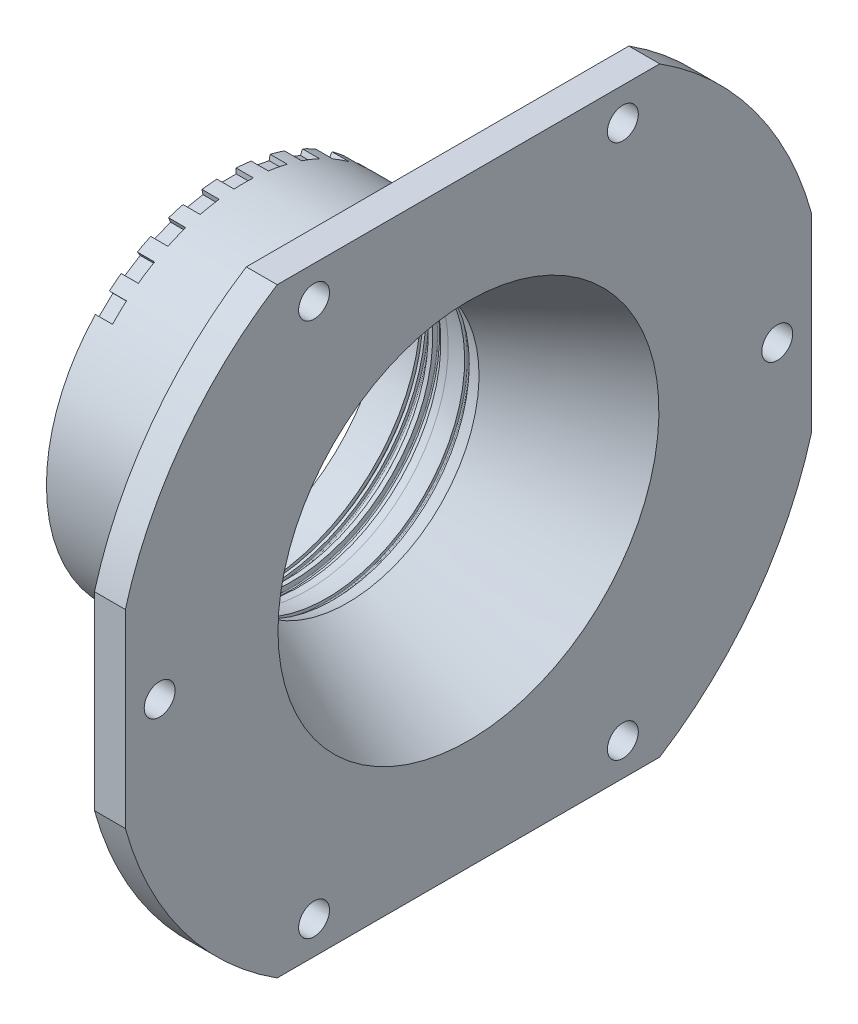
ISO-10303-21;
HEADER;
FILE_DESCRIPTION(('STEP AP214'),'2;1');
FILE_NAME('part.step','',(''),(''),'','','');
FILE_SCHEMA(('AUTOMOTIVE_DESIGN { 1 0 10303 214 1 1 1 1 }'));
ENDSEC;
DATA;
#1=APPLICATION_CONTEXT('core data for automotive mechanical design processes');
#2=APPLICATION_PROTOCOL_DEFINITION('international standard','automotive_design',2000,#1);
#3=PRODUCT_CONTEXT('',#1,'mechanical');
#4=PRODUCT('Part','Part','',(#3));
#5=PRODUCT_RELATED_PRODUCT_CATEGORY('part','',(#4));
#6=PRODUCT_DEFINITION_FORMATION('','',#4);
#7=PRODUCT_DEFINITION_CONTEXT('part definition',#1,'design');
#8=PRODUCT_DEFINITION('design','',#6,#7);
#9=PRODUCT_DEFINITION_SHAPE('','',#8);
#10=(LENGTH_UNIT() NAMED_UNIT(*) SI_UNIT(.MILLI.,.METRE.));
#11=(NAMED_UNIT(*) PLANE_ANGLE_UNIT() SI_UNIT($,.RADIAN.));
#12=(NAMED_UNIT(*) SI_UNIT($,.STERADIAN.) SOLID_ANGLE_UNIT());
#13=UNCERTAINTY_MEASURE_WITH_UNIT(LENGTH_MEASURE(1.E-05),#10,'distance_accuracy_value','');
#14=(GEOMETRIC_REPRESENTATION_CONTEXT(3) GLOBAL_UNCERTAINTY_ASSIGNED_CONTEXT((#13)) GLOBAL_UNIT_ASSIGNED_CONTEXT((#10,
#11,#12)) REPRESENTATION_CONTEXT('',''));
#15=CARTESIAN_POINT('',(0.,0.,0.));
#16=DIRECTION('',(0.,0.,1.));
#17=DIRECTION('',(1.,0.,0.));
#18=AXIS2_PLACEMENT_3D('',#15,#16,#17);
#19=CARTESIAN_POINT('',(141.000000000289,111.022503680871,0.));
#20=DIRECTION('',(-1.,0.,0.));
#21=DIRECTION('',(0.,0.,1.));
#22=AXIS2_PLACEMENT_3D('',#19,#20,#21);
#23=PLANE('',#22);
#24=CARTESIAN_POINT('',(141.000000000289,3.15025783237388E-12,-180.));
#25=DIRECTION('',(-1.,0.,0.));
#26=DIRECTION('',(0.,0.,1.));
#27=AXIS2_PLACEMENT_3D('',#24,#25,#26);
#28=CIRCLE('',#27,9.);
#29=CARTESIAN_POINT('',(141.000000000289,3.15025783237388E-12,-171.));
#30=VERTEX_POINT('',#29);
#31=EDGE_CURVE('E546',#30,#30,#28,.T.);
#32=ORIENTED_EDGE('',*,*,#31,.T.);
#33=EDGE_LOOP('',(#32));
#34=FACE_BOUND('',#33,.T.);
#35=CARTESIAN_POINT('',(141.000000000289,-155.884572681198,-90.0000000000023));
#36=DIRECTION('',(-1.,0.,0.));
#37=DIRECTION('',(0.,0.,1.));
#38=AXIS2_PLACEMENT_3D('',#35,#36,#37);
#39=CIRCLE('',#38,9.00000000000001);
#40=CARTESIAN_POINT('',(141.000000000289,-155.884572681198,-81.0000000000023));
#41=VERTEX_POINT('',#40);
#42=EDGE_CURVE('E552',#41,#41,#39,.T.);
#43=ORIENTED_EDGE('',*,*,#42,.T.);
#44=EDGE_LOOP('',(#43));
#45=FACE_BOUND('',#44,.T.);
#46=CARTESIAN_POINT('',(141.000000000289,-155.8845726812,89.999999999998));
#47=DIRECTION('',(-1.,0.,0.));
#48=DIRECTION('',(0.,0.,1.));
#49=AXIS2_PLACEMENT_3D('',#46,#47,#48);
#50=CIRCLE('',#49,9.);
#51=CARTESIAN_POINT('',(141.000000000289,-155.8845726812,98.999999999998));
#52=VERTEX_POINT('',#51);
#53=EDGE_CURVE('E558',#52,#52,#50,.T.);
#54=ORIENTED_EDGE('',*,*,#53,.T.);
#55=EDGE_LOOP('',(#54));
#56=FACE_BOUND('',#55,.T.);
#57=CARTESIAN_POINT('',(141.000000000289,-1.87350135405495E-12,180.));
#58=DIRECTION('',(-1.,0.,0.));
#59=DIRECTION('',(0.,0.,1.));
#60=AXIS2_PLACEMENT_3D('',#57,#58,#59);
#61=CIRCLE('',#60,9.);
#62=CARTESIAN_POINT('',(141.000000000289,-1.87350135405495E-12,189.));
#63=VERTEX_POINT('',#62);
#64=EDGE_CURVE('E564',#63,#63,#61,.T.);
#65=ORIENTED_EDGE('',*,*,#64,.T.);
#66=EDGE_LOOP('',(#65));
#67=FACE_BOUND('',#66,.T.);
#68=CARTESIAN_POINT('',(141.000000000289,155.884572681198,90.0000000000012));
#69=DIRECTION('',(-1.,0.,0.));
#70=DIRECTION('',(0.,0.,1.));
#71=AXIS2_PLACEMENT_3D('',#68,#69,#70);
#72=CIRCLE('',#71,8.99999999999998);
#73=CARTESIAN_POINT('',(141.000000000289,155.884572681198,99.0000000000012));
#74=VERTEX_POINT('',#73);
#75=EDGE_CURVE('E570',#74,#74,#72,.T.);
#76=ORIENTED_EDGE('',*,*,#75,.T.);
#77=EDGE_LOOP('',(#76));
#78=FACE_BOUND('',#77,.T.);
#79=CARTESIAN_POINT('',(141.000000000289,155.884572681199,-89.9999999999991));
#80=DIRECTION('',(-1.,0.,0.));
#81=DIRECTION('',(0.,0.,1.));
#82=AXIS2_PLACEMENT_3D('',#79,#80,#81);
#83=CIRCLE('',#82,9.);
#84=CARTESIAN_POINT('',(141.000000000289,155.884572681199,-80.9999999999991));
#85=VERTEX_POINT('',#84);
#86=EDGE_CURVE('E576',#85,#85,#83,.T.);
#87=ORIENTED_EDGE('',*,*,#86,.T.);
#88=EDGE_LOOP('',(#87));
#89=FACE_BOUND('',#88,.T.);
#90=CARTESIAN_POINT('',(141.000000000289,0.,0.));
#91=DIRECTION('',(-1.,0.,0.));
#92=DIRECTION('',(0.,0.,1.));
#93=AXIS2_PLACEMENT_3D('',#90,#91,#92);
#94=CIRCLE('',#93,111.022503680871);
#95=CARTESIAN_POINT('',(141.000000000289,0.,111.022503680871));
#96=VERTEX_POINT('',#95);
#97=EDGE_CURVE('E629',#96,#96,#94,.T.);
#98=ORIENTED_EDGE('',*,*,#97,.T.);
#99=EDGE_LOOP('',(#98));
#100=FACE_BOUND('',#99,.T.);
#101=DIRECTION('',(0.,-1.,0.));
#102=VECTOR('',#101,1.);
#103=CARTESIAN_POINT('',(141.000000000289,111.022503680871,-200.));
#104=LINE('',#103,#102);
#105=CARTESIAN_POINT('',(141.000000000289,55.2833609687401,-200.));
#106=VERTEX_POINT('',#105);
#107=CARTESIAN_POINT('',(141.000000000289,-55.2833609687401,-200.));
#108=VERTEX_POINT('',#107);
#109=EDGE_CURVE('E599',#106,#108,#104,.T.);
#110=ORIENTED_EDGE('',*,*,#109,.F.);
#111=CARTESIAN_POINT('',(141.000000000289,0.,0.));
#112=DIRECTION('',(-1.,0.,0.));
#113=DIRECTION('',(0.,0.,1.));
#114=AXIS2_PLACEMENT_3D('',#111,#112,#113);
#115=CIRCLE('',#114,207.5);
#116=CARTESIAN_POINT('',(141.000000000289,175.,-111.495515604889));
#117=VERTEX_POINT('',#116);
#118=EDGE_CURVE('E630',#117,#106,#115,.T.);
#119=ORIENTED_EDGE('',*,*,#118,.F.);
#120=DIRECTION('',(0.,0.,-1.));
#121=VECTOR('',#120,1.);
#122=CARTESIAN_POINT('',(141.000000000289,175.,0.));
#123=LINE('',#122,#121);
#124=CARTESIAN_POINT('',(141.000000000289,175.,111.495515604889));
#125=VERTEX_POINT('',#124);
#126=EDGE_CURVE('E593',#125,#117,#123,.T.);
#127=ORIENTED_EDGE('',*,*,#126,.F.);
#128=CARTESIAN_POINT('',(141.000000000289,55.2833609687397,200.));
#129=VERTEX_POINT('',#128);
#130=EDGE_CURVE('E626',#129,#125,#115,.T.);
#131=ORIENTED_EDGE('',*,*,#130,.F.);
#132=DIRECTION('',(0.,1.,0.));
#133=VECTOR('',#132,1.);
#134=CARTESIAN_POINT('',(141.000000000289,111.022503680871,200.));
#135=LINE('',#134,#133);
#136=CARTESIAN_POINT('',(141.000000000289,-55.2833609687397,200.));
#137=VERTEX_POINT('',#136);
#138=EDGE_CURVE('E587',#137,#129,#135,.T.);
#139=ORIENTED_EDGE('',*,*,#138,.F.);
#140=CARTESIAN_POINT('',(141.000000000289,-175.,111.495515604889));
#141=VERTEX_POINT('',#140);
#142=EDGE_CURVE('E624',#141,#137,#115,.T.);
#143=ORIENTED_EDGE('',*,*,#142,.F.);
#144=DIRECTION('',(0.,0.,1.));
#145=VECTOR('',#144,1.);
#146=CARTESIAN_POINT('',(141.000000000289,-175.,0.));
#147=LINE('',#146,#145);
#148=CARTESIAN_POINT('',(141.000000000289,-175.,-111.495515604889));
#149=VERTEX_POINT('',#148);
#150=EDGE_CURVE('E581',#149,#141,#147,.T.);
#151=ORIENTED_EDGE('',*,*,#150,.F.);
#152=EDGE_CURVE('E1025',#108,#149,#115,.T.);
#153=ORIENTED_EDGE('',*,*,#152,.F.);
#154=EDGE_LOOP('',(#110,#119,#127,#131,#139,#143,#151,#153));
#155=FACE_BOUND('',#154,.T.);
#156=ADVANCED_FACE('F33',(#34,#45,#56,#67,#78,#89,#100,#155),#23,.F.);
#157=CARTESIAN_POINT('',(-14.7589980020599,0.,0.));
#158=DIRECTION('',(-1.,0.,0.));
#159=DIRECTION('',(0.,0.,1.));
#160=AXIS2_PLACEMENT_3D('',#157,#158,#159);
#161=CYLINDRICAL_SURFACE('',#160,207.5);
#162=DIRECTION('',(-1.,0.,0.));
#163=VECTOR('',#162,1.);
#164=CARTESIAN_POINT('',(-14.7589980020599,-55.2833609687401,-200.));
#165=LINE('',#164,#163);
#166=CARTESIAN_POINT('',(123.00000000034,-55.2833609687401,-200.));
#167=VERTEX_POINT('',#166);
#168=EDGE_CURVE('E601',#108,#167,#165,.T.);
#169=ORIENTED_EDGE('',*,*,#168,.F.);
#170=ORIENTED_EDGE('',*,*,#152,.T.);
#171=DIRECTION('',(-1.,0.,0.));
#172=VECTOR('',#171,1.);
#173=CARTESIAN_POINT('',(-14.7589980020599,-175.,-111.495515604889));
#174=LINE('',#173,#172);
#175=CARTESIAN_POINT('',(123.00000000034,-175.,-111.495515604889));
#176=VERTEX_POINT('',#175);
#177=EDGE_CURVE('E579',#176,#149,#174,.F.);
#178=ORIENTED_EDGE('',*,*,#177,.F.);
#179=CARTESIAN_POINT('',(123.00000000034,0.,0.));
#180=DIRECTION('',(-1.,0.,0.));
#181=DIRECTION('',(0.,0.,1.));
#182=AXIS2_PLACEMENT_3D('',#179,#180,#181);
#183=CIRCLE('',#182,207.5);
#184=EDGE_CURVE('E991',#167,#176,#183,.T.);
#185=ORIENTED_EDGE('',*,*,#184,.F.);
#186=EDGE_LOOP('',(#169,#170,#178,#185));
#187=FACE_BOUND('',#186,.T.);
#188=ADVANCED_FACE('F821',(#187),#161,.T.);
#189=DIRECTION('',(-1.,0.,0.));
#190=VECTOR('',#189,1.);
#191=CARTESIAN_POINT('',(-14.7589980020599,55.2833609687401,-200.));
#192=LINE('',#191,#190);
#193=CARTESIAN_POINT('',(123.00000000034,55.2833609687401,-200.));
#194=VERTEX_POINT('',#193);
#195=EDGE_CURVE('E597',#194,#106,#192,.F.);
#196=ORIENTED_EDGE('',*,*,#195,.F.);
#197=CARTESIAN_POINT('',(123.00000000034,175.,-111.495515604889));
#198=VERTEX_POINT('',#197);
#199=EDGE_CURVE('E625',#198,#194,#183,.T.);
#200=ORIENTED_EDGE('',*,*,#199,.F.);
#201=DIRECTION('',(-1.,0.,0.));
#202=VECTOR('',#201,1.);
#203=CARTESIAN_POINT('',(-14.7589980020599,175.,-111.495515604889));
#204=LINE('',#203,#202);
#205=EDGE_CURVE('E595',#117,#198,#204,.T.);
#206=ORIENTED_EDGE('',*,*,#205,.F.);
#207=ORIENTED_EDGE('',*,*,#118,.T.);
#208=EDGE_LOOP('',(#196,#200,#206,#207));
#209=FACE_BOUND('',#208,.T.);
#210=ADVANCED_FACE('F827',(#209),#161,.T.);
#211=DIRECTION('',(-1.,0.,0.));
#212=VECTOR('',#211,1.);
#213=CARTESIAN_POINT('',(-14.7589980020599,175.,111.495515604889));
#214=LINE('',#213,#212);
#215=CARTESIAN_POINT('',(123.00000000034,175.,111.495515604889));
#216=VERTEX_POINT('',#215);
#217=EDGE_CURVE('E591',#216,#125,#214,.F.);
#218=ORIENTED_EDGE('',*,*,#217,.F.);
#219=CARTESIAN_POINT('',(123.00000000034,55.2833609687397,200.));
#220=VERTEX_POINT('',#219);
#221=EDGE_CURVE('E621',#220,#216,#183,.T.);
#222=ORIENTED_EDGE('',*,*,#221,.F.);
#223=DIRECTION('',(-1.,0.,0.));
#224=VECTOR('',#223,1.);
#225=CARTESIAN_POINT('',(-14.7589980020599,55.2833609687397,200.));
#226=LINE('',#225,#224);
#227=EDGE_CURVE('E589',#129,#220,#226,.T.);
#228=ORIENTED_EDGE('',*,*,#227,.F.);
#229=ORIENTED_EDGE('',*,*,#130,.T.);
#230=EDGE_LOOP('',(#218,#222,#228,#229));
#231=FACE_BOUND('',#230,.T.);
#232=ADVANCED_FACE('F970',(#231),#161,.T.);
#233=DIRECTION('',(-1.,0.,0.));
#234=VECTOR('',#233,1.);
#235=CARTESIAN_POINT('',(-14.7589980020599,-55.2833609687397,200.));
#236=LINE('',#235,#234);
#237=CARTESIAN_POINT('',(123.00000000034,-55.2833609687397,200.));
#238=VERTEX_POINT('',#237);
#239=EDGE_CURVE('E585',#238,#137,#236,.F.);
#240=ORIENTED_EDGE('',*,*,#239,.F.);
#241=CARTESIAN_POINT('',(123.00000000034,-175.,111.495515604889));
#242=VERTEX_POINT('',#241);
#243=EDGE_CURVE('E620',#242,#238,#183,.T.);
#244=ORIENTED_EDGE('',*,*,#243,.F.);
#245=DIRECTION('',(-1.,0.,0.));
#246=VECTOR('',#245,1.);
#247=CARTESIAN_POINT('',(-14.7589980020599,-175.,111.495515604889));
#248=LINE('',#247,#246);
#249=EDGE_CURVE('E583',#141,#242,#248,.T.);
#250=ORIENTED_EDGE('',*,*,#249,.F.);
#251=ORIENTED_EDGE('',*,*,#142,.T.);
#252=EDGE_LOOP('',(#240,#244,#250,#251));
#253=FACE_BOUND('',#252,.T.);
#254=ADVANCED_FACE('F830',(#253),#161,.T.);
#255=CARTESIAN_POINT('',(123.00000000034,120.607442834,0.));
#256=DIRECTION('',(1.,0.,0.));
#257=DIRECTION('',(0.,0.,-1.));
#258=AXIS2_PLACEMENT_3D('',#255,#256,#257);
#259=PLANE('',#258);
#260=CARTESIAN_POINT('',(123.00000000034,3.15025783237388E-12,-180.));
#261=DIRECTION('',(-1.,0.,0.));
#262=DIRECTION('',(0.,0.,1.));
#263=AXIS2_PLACEMENT_3D('',#260,#261,#262);
#264=CIRCLE('',#263,9.);
#265=CARTESIAN_POINT('',(123.00000000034,3.15025783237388E-12,-171.));
#266=VERTEX_POINT('',#265);
#267=EDGE_CURVE('E543',#266,#266,#264,.T.);
#268=ORIENTED_EDGE('',*,*,#267,.F.);
#269=EDGE_LOOP('',(#268));
#270=FACE_BOUND('',#269,.T.);
#271=CARTESIAN_POINT('',(123.00000000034,-155.884572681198,-90.0000000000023));
#272=DIRECTION('',(-1.,0.,0.));
#273=DIRECTION('',(0.,0.,1.));
#274=AXIS2_PLACEMENT_3D('',#271,#272,#273);
#275=CIRCLE('',#274,9.00000000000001);
#276=CARTESIAN_POINT('',(123.00000000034,-155.884572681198,-81.0000000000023));
#277=VERTEX_POINT('',#276);
#278=EDGE_CURVE('E549',#277,#277,#275,.T.);
#279=ORIENTED_EDGE('',*,*,#278,.F.);
#280=EDGE_LOOP('',(#279));
#281=FACE_BOUND('',#280,.T.);
#282=CARTESIAN_POINT('',(123.00000000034,-155.8845726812,89.999999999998));
#283=DIRECTION('',(-1.,0.,0.));
#284=DIRECTION('',(0.,0.,1.));
#285=AXIS2_PLACEMENT_3D('',#282,#283,#284);
#286=CIRCLE('',#285,9.);
#287=CARTESIAN_POINT('',(123.00000000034,-155.8845726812,98.999999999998));
#288=VERTEX_POINT('',#287);
#289=EDGE_CURVE('E555',#288,#288,#286,.T.);
#290=ORIENTED_EDGE('',*,*,#289,.F.);
#291=EDGE_LOOP('',(#290));
#292=FACE_BOUND('',#291,.T.);
#293=CARTESIAN_POINT('',(123.00000000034,-1.87350135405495E-12,180.));
#294=DIRECTION('',(-1.,0.,0.));
#295=DIRECTION('',(0.,0.,1.));
#296=AXIS2_PLACEMENT_3D('',#293,#294,#295);
#297=CIRCLE('',#296,9.);
#298=CARTESIAN_POINT('',(123.00000000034,-1.87350135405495E-12,189.));
#299=VERTEX_POINT('',#298);
#300=EDGE_CURVE('E561',#299,#299,#297,.T.);
#301=ORIENTED_EDGE('',*,*,#300,.F.);
#302=EDGE_LOOP('',(#301));
#303=FACE_BOUND('',#302,.T.);
#304=CARTESIAN_POINT('',(123.00000000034,155.884572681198,90.0000000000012));
#305=DIRECTION('',(-1.,0.,0.));
#306=DIRECTION('',(0.,0.,1.));
#307=AXIS2_PLACEMENT_3D('',#304,#305,#306);
#308=CIRCLE('',#307,8.99999999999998);
#309=CARTESIAN_POINT('',(123.00000000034,155.884572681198,99.0000000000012));
#310=VERTEX_POINT('',#309);
#311=EDGE_CURVE('E567',#310,#310,#308,.T.);
#312=ORIENTED_EDGE('',*,*,#311,.F.);
#313=EDGE_LOOP('',(#312));
#314=FACE_BOUND('',#313,.T.);
#315=CARTESIAN_POINT('',(123.00000000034,155.884572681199,-89.9999999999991));
#316=DIRECTION('',(-1.,0.,0.));
#317=DIRECTION('',(0.,0.,1.));
#318=AXIS2_PLACEMENT_3D('',#315,#316,#317);
#319=CIRCLE('',#318,9.);
#320=CARTESIAN_POINT('',(123.00000000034,155.884572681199,-80.9999999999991));
#321=VERTEX_POINT('',#320);
#322=EDGE_CURVE('E573',#321,#321,#319,.T.);
#323=ORIENTED_EDGE('',*,*,#322,.F.);
#324=EDGE_LOOP('',(#323));
#325=FACE_BOUND('',#324,.T.);
#326=CARTESIAN_POINT('',(123.00000000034,0.,0.));
#327=DIRECTION('',(-1.,0.,0.));
#328=DIRECTION('',(0.,0.,1.));
#329=AXIS2_PLACEMENT_3D('',#326,#327,#328);
#330=CIRCLE('',#329,120.607442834);
#331=CARTESIAN_POINT('',(123.00000000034,0.,120.607442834));
#332=VERTEX_POINT('',#331);
#333=EDGE_CURVE('E617',#332,#332,#330,.T.);
#334=ORIENTED_EDGE('',*,*,#333,.F.);
#335=EDGE_LOOP('',(#334));
#336=FACE_BOUND('',#335,.T.);
#337=DIRECTION('',(0.,1.,0.));
#338=VECTOR('',#337,1.);
#339=CARTESIAN_POINT('',(123.00000000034,120.607442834,-200.));
#340=LINE('',#339,#338);
#341=EDGE_CURVE('E717',#167,#194,#340,.T.);
#342=ORIENTED_EDGE('',*,*,#341,.F.);
#343=ORIENTED_EDGE('',*,*,#184,.T.);
#344=DIRECTION('',(0.,0.,-1.));
#345=VECTOR('',#344,1.);
#346=CARTESIAN_POINT('',(123.00000000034,-175.,0.));
#347=LINE('',#346,#345);
#348=EDGE_CURVE('E711',#242,#176,#347,.T.);
#349=ORIENTED_EDGE('',*,*,#348,.F.);
#350=ORIENTED_EDGE('',*,*,#243,.T.);
#351=DIRECTION('',(0.,-1.,0.));
#352=VECTOR('',#351,1.);
#353=CARTESIAN_POINT('',(123.00000000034,120.607442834,200.));
#354=LINE('',#353,#352);
#355=EDGE_CURVE('E713',#220,#238,#354,.T.);
#356=ORIENTED_EDGE('',*,*,#355,.F.);
#357=ORIENTED_EDGE('',*,*,#221,.T.);
#358=DIRECTION('',(0.,0.,1.));
#359=VECTOR('',#358,1.);
#360=CARTESIAN_POINT('',(123.00000000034,175.,0.));
#361=LINE('',#360,#359);
#362=EDGE_CURVE('E715',#198,#216,#361,.T.);
#363=ORIENTED_EDGE('',*,*,#362,.F.);
#364=ORIENTED_EDGE('',*,*,#199,.T.);
#365=EDGE_LOOP('',(#342,#343,#349,#350,#356,#357,#363,#364));
#366=FACE_BOUND('',#365,.T.);
#367=ADVANCED_FACE('F940',(#270,#281,#292,#303,#314,#325,#336,#366),#259,.F.);
#368=CARTESIAN_POINT('',(20.4000000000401,92.75,0.));
#369=DIRECTION('',(-1.,0.,0.));
#370=DIRECTION('',(0.,0.,1.));
#371=AXIS2_PLACEMENT_3D('',#368,#369,#370);
#372=PLANE('',#371);
#373=CARTESIAN_POINT('',(20.4000000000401,0.,0.));
#374=DIRECTION('',(-1.,0.,0.));
#375=DIRECTION('',(0.,0.,1.));
#376=AXIS2_PLACEMENT_3D('',#373,#374,#375);
#377=CIRCLE('',#376,95.);
#378=CARTESIAN_POINT('',(20.4000000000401,0.,95.));
#379=VERTEX_POINT('',#378);
#380=EDGE_CURVE('E708',#379,#379,#377,.T.);
#381=ORIENTED_EDGE('',*,*,#380,.F.);
#382=EDGE_LOOP('',(#381));
#383=FACE_BOUND('',#382,.T.);
#384=CARTESIAN_POINT('',(20.4000000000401,0.,0.));
#385=DIRECTION('',(-1.,0.,0.));
#386=DIRECTION('',(0.,0.,1.));
#387=AXIS2_PLACEMENT_3D('',#384,#385,#386);
#388=CIRCLE('',#387,92.75);
#389=CARTESIAN_POINT('',(20.4000000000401,0.,92.75));
#390=VERTEX_POINT('',#389);
#391=EDGE_CURVE('E603',#390,#390,#388,.T.);
#392=ORIENTED_EDGE('',*,*,#391,.T.);
#393=EDGE_LOOP('',(#392));
#394=FACE_BOUND('',#393,.T.);
#395=ADVANCED_FACE('F35',(#383,#394),#372,.F.);
#396=CARTESIAN_POINT('',(-14.7589980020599,0.,0.));
#397=DIRECTION('',(-1.,0.,0.));
#398=DIRECTION('',(0.,0.,1.));
#399=AXIS2_PLACEMENT_3D('',#396,#397,#398);
#400=CYLINDRICAL_SURFACE('',#399,95.);
#401=CARTESIAN_POINT('',(23.4000000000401,0.,0.));
#402=DIRECTION('',(-1.,0.,0.));
#403=DIRECTION('',(0.,0.,1.));
#404=AXIS2_PLACEMENT_3D('',#401,#402,#403);
#405=CIRCLE('',#404,95.);
#406=CARTESIAN_POINT('',(23.4000000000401,0.,95.));
#407=VERTEX_POINT('',#406);
#408=EDGE_CURVE('E705',#407,#407,#405,.T.);
#409=ORIENTED_EDGE('',*,*,#408,.F.);
#410=EDGE_LOOP('',(#409));
#411=FACE_BOUND('',#410,.T.);
#412=ORIENTED_EDGE('',*,*,#380,.T.);
#413=EDGE_LOOP('',(#412));
#414=FACE_BOUND('',#413,.T.);
#415=ADVANCED_FACE('F933',(#411,#414),#400,.F.);
#416=CARTESIAN_POINT('',(23.4000000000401,91.,0.));
#417=DIRECTION('',(1.,0.,0.));
#418=DIRECTION('',(0.,0.,-1.));
#419=AXIS2_PLACEMENT_3D('',#416,#417,#418);
#420=PLANE('',#419);
#421=CARTESIAN_POINT('',(23.4000000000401,0.,0.));
#422=DIRECTION('',(-1.,0.,0.));
#423=DIRECTION('',(0.,0.,1.));
#424=AXIS2_PLACEMENT_3D('',#421,#422,#423);
#425=CIRCLE('',#424,91.);
#426=CARTESIAN_POINT('',(23.4000000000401,0.,91.));
#427=VERTEX_POINT('',#426);
#428=EDGE_CURVE('E702',#427,#427,#425,.T.);
#429=ORIENTED_EDGE('',*,*,#428,.F.);
#430=EDGE_LOOP('',(#429));
#431=FACE_BOUND('',#430,.T.);
#432=ORIENTED_EDGE('',*,*,#408,.T.);
#433=EDGE_LOOP('',(#432));
#434=FACE_BOUND('',#433,.T.);
#435=ADVANCED_FACE('F930',(#431,#434),#420,.F.);
#436=CARTESIAN_POINT('',(-14.7589980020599,0.,0.));
#437=DIRECTION('',(-1.,0.,0.));
#438=DIRECTION('',(0.,0.,1.));
#439=AXIS2_PLACEMENT_3D('',#436,#437,#438);
#440=CYLINDRICAL_SURFACE('',#439,91.);
#441=CARTESIAN_POINT('',(25.10000000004,0.,0.));
#442=DIRECTION('',(-1.,0.,0.));
#443=DIRECTION('',(0.,0.,1.));
#444=AXIS2_PLACEMENT_3D('',#441,#442,#443);
#445=CIRCLE('',#444,91.);
#446=CARTESIAN_POINT('',(25.10000000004,0.,91.));
#447=VERTEX_POINT('',#446);
#448=EDGE_CURVE('E699',#447,#447,#445,.T.);
#449=ORIENTED_EDGE('',*,*,#448,.F.);
#450=EDGE_LOOP('',(#449));
#451=FACE_BOUND('',#450,.T.);
#452=ORIENTED_EDGE('',*,*,#428,.T.);
#453=EDGE_LOOP('',(#452));
#454=FACE_BOUND('',#453,.T.);
#455=ADVANCED_FACE('F926',(#451,#454),#440,.F.);
#456=CARTESIAN_POINT('',(25.10000000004,91.,0.));
#457=DIRECTION('',(-1.,0.,0.));
#458=DIRECTION('',(0.,0.,1.));
#459=AXIS2_PLACEMENT_3D('',#456,#457,#458);
#460=PLANE('',#459);
#461=CARTESIAN_POINT('',(25.10000000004,0.,0.));
#462=DIRECTION('',(-1.,0.,0.));
#463=DIRECTION('',(0.,0.,1.));
#464=AXIS2_PLACEMENT_3D('',#461,#462,#463);
#465=CIRCLE('',#464,92.6999999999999);
#466=CARTESIAN_POINT('',(25.10000000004,0.,92.6999999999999));
#467=VERTEX_POINT('',#466);
#468=EDGE_CURVE('E696',#467,#467,#465,.T.);
#469=ORIENTED_EDGE('',*,*,#468,.F.);
#470=EDGE_LOOP('',(#469));
#471=FACE_BOUND('',#470,.T.);
#472=ORIENTED_EDGE('',*,*,#448,.T.);
#473=EDGE_LOOP('',(#472));
#474=FACE_BOUND('',#473,.T.);
#475=ADVANCED_FACE('F922',(#471,#474),#460,.F.);
#476=CARTESIAN_POINT('',(25.70000000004,0.,0.));
#477=DIRECTION('',(-1.,0.,0.));
#478=DIRECTION('',(0.,0.,1.));
#479=AXIS2_PLACEMENT_3D('',#476,#477,#478);
#480=TOROIDAL_SURFACE('',#479,92.6999999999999,0.600000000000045);
#481=CARTESIAN_POINT('',(25.70000000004,0.,0.));
#482=DIRECTION('',(-1.,0.,0.));
#483=DIRECTION('',(0.,0.,1.));
#484=AXIS2_PLACEMENT_3D('',#481,#482,#483);
#485=CIRCLE('',#484,93.3);
#486=CARTESIAN_POINT('',(25.70000000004,0.,93.3));
#487=VERTEX_POINT('',#486);
#488=EDGE_CURVE('E693',#487,#487,#485,.T.);
#489=ORIENTED_EDGE('',*,*,#488,.F.);
#490=EDGE_LOOP('',(#489));
#491=FACE_BOUND('',#490,.T.);
#492=ORIENTED_EDGE('',*,*,#468,.T.);
#493=EDGE_LOOP('',(#492));
#494=FACE_BOUND('',#493,.T.);
#495=ADVANCED_FACE('F918',(#491,#494),#480,.F.);
#496=CARTESIAN_POINT('',(-14.7589980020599,0.,0.));
#497=DIRECTION('',(-1.,0.,0.));
#498=DIRECTION('',(0.,0.,1.));
#499=AXIS2_PLACEMENT_3D('',#496,#497,#498);
#500=CYLINDRICAL_SURFACE('',#499,93.3);
#501=CARTESIAN_POINT('',(28.4000000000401,0.,0.));
#502=DIRECTION('',(-1.,0.,0.));
#503=DIRECTION('',(0.,0.,1.));
#504=AXIS2_PLACEMENT_3D('',#501,#502,#503);
#505=CIRCLE('',#504,93.3);
#506=CARTESIAN_POINT('',(28.4000000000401,0.,93.3));
#507=VERTEX_POINT('',#506);
#508=EDGE_CURVE('E690',#507,#507,#505,.T.);
#509=ORIENTED_EDGE('',*,*,#508,.F.);
#510=EDGE_LOOP('',(#509));
#511=FACE_BOUND('',#510,.T.);
#512=ORIENTED_EDGE('',*,*,#488,.T.);
#513=EDGE_LOOP('',(#512));
#514=FACE_BOUND('',#513,.T.);
#515=ADVANCED_FACE('F914',(#511,#514),#500,.F.);
#516=CARTESIAN_POINT('',(28.4000000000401,0.,0.));
#517=DIRECTION('',(-1.,0.,0.));
#518=DIRECTION('',(0.,0.,1.));
#519=AXIS2_PLACEMENT_3D('',#516,#517,#518);
#520=TOROIDAL_SURFACE('',#519,92.6999999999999,0.600000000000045);
#521=CARTESIAN_POINT('',(29.0000000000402,0.,0.));
#522=DIRECTION('',(-1.,0.,0.));
#523=DIRECTION('',(0.,0.,1.));
#524=AXIS2_PLACEMENT_3D('',#521,#522,#523);
#525=CIRCLE('',#524,92.6999999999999);
#526=CARTESIAN_POINT('',(29.0000000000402,0.,92.6999999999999));
#527=VERTEX_POINT('',#526);
#528=EDGE_CURVE('E687',#527,#527,#525,.T.);
#529=ORIENTED_EDGE('',*,*,#528,.F.);
#530=EDGE_LOOP('',(#529));
#531=FACE_BOUND('',#530,.T.);
#532=ORIENTED_EDGE('',*,*,#508,.T.);
#533=EDGE_LOOP('',(#532));
#534=FACE_BOUND('',#533,.T.);
#535=ADVANCED_FACE('F910',(#531,#534),#520,.F.);
#536=CARTESIAN_POINT('',(29.0000000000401,91.,0.));
#537=DIRECTION('',(1.,0.,0.));
#538=DIRECTION('',(0.,0.,-1.));
#539=AXIS2_PLACEMENT_3D('',#536,#537,#538);
#540=PLANE('',#539);
#541=CARTESIAN_POINT('',(29.0000000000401,0.,0.));
#542=DIRECTION('',(-1.,0.,0.));
#543=DIRECTION('',(0.,0.,1.));
#544=AXIS2_PLACEMENT_3D('',#541,#542,#543);
#545=CIRCLE('',#544,91.);
#546=CARTESIAN_POINT('',(29.0000000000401,0.,91.));
#547=VERTEX_POINT('',#546);
#548=EDGE_CURVE('E684',#547,#547,#545,.T.);
#549=ORIENTED_EDGE('',*,*,#548,.F.);
#550=EDGE_LOOP('',(#549));
#551=FACE_BOUND('',#550,.T.);
#552=ORIENTED_EDGE('',*,*,#528,.T.);
#553=EDGE_LOOP('',(#552));
#554=FACE_BOUND('',#553,.T.);
#555=ADVANCED_FACE('F906',(#551,#554),#540,.F.);
#556=CARTESIAN_POINT('',(-14.7589980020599,0.,0.));
#557=DIRECTION('',(-1.,0.,0.));
#558=DIRECTION('',(0.,0.,1.));
#559=AXIS2_PLACEMENT_3D('',#556,#557,#558);
#560=CYLINDRICAL_SURFACE('',#559,91.);
#561=CARTESIAN_POINT('',(35.0000000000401,0.,0.));
#562=DIRECTION('',(-1.,0.,0.));
#563=DIRECTION('',(0.,0.,1.));
#564=AXIS2_PLACEMENT_3D('',#561,#562,#563);
#565=CIRCLE('',#564,91.);
#566=CARTESIAN_POINT('',(35.0000000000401,0.,91.));
#567=VERTEX_POINT('',#566);
#568=EDGE_CURVE('E681',#567,#567,#565,.T.);
#569=ORIENTED_EDGE('',*,*,#568,.F.);
#570=EDGE_LOOP('',(#569));
#571=FACE_BOUND('',#570,.T.);
#572=ORIENTED_EDGE('',*,*,#548,.T.);
#573=EDGE_LOOP('',(#572));
#574=FACE_BOUND('',#573,.T.);
#575=ADVANCED_FACE('F902',(#571,#574),#560,.F.);
#576=CARTESIAN_POINT('',(35.0000000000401,82.55,0.));
#577=DIRECTION('',(1.,0.,0.));
#578=DIRECTION('',(0.,0.,-1.));
#579=AXIS2_PLACEMENT_3D('',#576,#577,#578);
#580=PLANE('',#579);
#581=CARTESIAN_POINT('',(35.0000000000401,0.,0.));
#582=DIRECTION('',(-1.,0.,0.));
#583=DIRECTION('',(0.,0.,1.));
#584=AXIS2_PLACEMENT_3D('',#581,#582,#583);
#585=CIRCLE('',#584,82.55);
#586=CARTESIAN_POINT('',(35.0000000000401,0.,82.55));
#587=VERTEX_POINT('',#586);
#588=EDGE_CURVE('E678',#587,#587,#585,.T.);
#589=ORIENTED_EDGE('',*,*,#588,.F.);
#590=EDGE_LOOP('',(#589));
#591=FACE_BOUND('',#590,.T.);
#592=ORIENTED_EDGE('',*,*,#568,.T.);
#593=EDGE_LOOP('',(#592));
#594=FACE_BOUND('',#593,.T.);
#595=ADVANCED_FACE('F898',(#591,#594),#580,.F.);
#596=CARTESIAN_POINT('',(-14.7589980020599,0.,0.));
#597=DIRECTION('',(-1.,0.,0.));
#598=DIRECTION('',(0.,0.,1.));
#599=AXIS2_PLACEMENT_3D('',#596,#597,#598);
#600=CYLINDRICAL_SURFACE('',#599,82.55);
#601=CARTESIAN_POINT('',(37.60000000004,0.,0.));
#602=DIRECTION('',(-1.,0.,0.));
#603=DIRECTION('',(0.,0.,1.));
#604=AXIS2_PLACEMENT_3D('',#601,#602,#603);
#605=CIRCLE('',#604,82.55);
#606=CARTESIAN_POINT('',(37.60000000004,0.,82.55));
#607=VERTEX_POINT('',#606);
#608=EDGE_CURVE('E675',#607,#607,#605,.T.);
#609=ORIENTED_EDGE('',*,*,#608,.F.);
#610=EDGE_LOOP('',(#609));
#611=FACE_BOUND('',#610,.T.);
#612=ORIENTED_EDGE('',*,*,#588,.T.);
#613=EDGE_LOOP('',(#612));
#614=FACE_BOUND('',#613,.T.);
#615=ADVANCED_FACE('F894',(#611,#614),#600,.F.);
#616=CARTESIAN_POINT('',(37.60000000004,82.55,0.));
#617=DIRECTION('',(-1.,0.,0.));
#618=DIRECTION('',(0.,0.,1.));
#619=AXIS2_PLACEMENT_3D('',#616,#617,#618);
#620=PLANE('',#619);
#621=CARTESIAN_POINT('',(37.60000000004,0.,0.));
#622=DIRECTION('',(-1.,0.,0.));
#623=DIRECTION('',(0.,0.,1.));
#624=AXIS2_PLACEMENT_3D('',#621,#622,#623);
#625=CIRCLE('',#624,85.4);
#626=CARTESIAN_POINT('',(37.60000000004,0.,85.4));
#627=VERTEX_POINT('',#626);
#628=EDGE_CURVE('E672',#627,#627,#625,.T.);
#629=ORIENTED_EDGE('',*,*,#628,.F.);
#630=EDGE_LOOP('',(#629));
#631=FACE_BOUND('',#630,.T.);
#632=ORIENTED_EDGE('',*,*,#608,.T.);
#633=EDGE_LOOP('',(#632));
#634=FACE_BOUND('',#633,.T.);
#635=ADVANCED_FACE('F890',(#631,#634),#620,.F.);
#636=CARTESIAN_POINT('',(38.2000000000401,0.,0.));
#637=DIRECTION('',(-1.,0.,0.));
#638=DIRECTION('',(0.,0.,1.));
#639=AXIS2_PLACEMENT_3D('',#636,#637,#638);
#640=TOROIDAL_SURFACE('',#639,85.4,0.600000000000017);
#641=CARTESIAN_POINT('',(38.2000000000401,0.,0.));
#642=DIRECTION('',(-1.,0.,0.));
#643=DIRECTION('',(0.,0.,1.));
#644=AXIS2_PLACEMENT_3D('',#641,#642,#643);
#645=CIRCLE('',#644,86.);
#646=CARTESIAN_POINT('',(38.2000000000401,0.,86.));
#647=VERTEX_POINT('',#646);
#648=EDGE_CURVE('E669',#647,#647,#645,.T.);
#649=ORIENTED_EDGE('',*,*,#648,.F.);
#650=EDGE_LOOP('',(#649));
#651=FACE_BOUND('',#650,.T.);
#652=ORIENTED_EDGE('',*,*,#628,.T.);
#653=EDGE_LOOP('',(#652));
#654=FACE_BOUND('',#653,.T.);
#655=ADVANCED_FACE('F886',(#651,#654),#640,.F.);
#656=CARTESIAN_POINT('',(-14.7589980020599,0.,0.));
#657=DIRECTION('',(-1.,0.,0.));
#658=DIRECTION('',(0.,0.,1.));
#659=AXIS2_PLACEMENT_3D('',#656,#657,#658);
#660=CYLINDRICAL_SURFACE('',#659,86.);
#661=CARTESIAN_POINT('',(41.80000000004,0.,0.));
#662=DIRECTION('',(-1.,0.,0.));
#663=DIRECTION('',(0.,0.,1.));
#664=AXIS2_PLACEMENT_3D('',#661,#662,#663);
#665=CIRCLE('',#664,85.9999999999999);
#666=CARTESIAN_POINT('',(41.80000000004,0.,85.9999999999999));
#667=VERTEX_POINT('',#666);
#668=EDGE_CURVE('E666',#667,#667,#665,.T.);
#669=ORIENTED_EDGE('',*,*,#668,.F.);
#670=EDGE_LOOP('',(#669));
#671=FACE_BOUND('',#670,.T.);
#672=ORIENTED_EDGE('',*,*,#648,.T.);
#673=EDGE_LOOP('',(#672));
#674=FACE_BOUND('',#673,.T.);
#675=ADVANCED_FACE('F882',(#671,#674),#660,.F.);
#676=CARTESIAN_POINT('',(41.80000000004,0.,0.));
#677=DIRECTION('',(-1.,0.,0.));
#678=DIRECTION('',(0.,0.,1.));
#679=AXIS2_PLACEMENT_3D('',#676,#677,#678);
#680=TOROIDAL_SURFACE('',#679,85.3999999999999,0.600000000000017);
#681=CARTESIAN_POINT('',(42.40000000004,0.,0.));
#682=DIRECTION('',(-1.,0.,0.));
#683=DIRECTION('',(0.,0.,1.));
#684=AXIS2_PLACEMENT_3D('',#681,#682,#683);
#685=CIRCLE('',#684,85.3999999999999);
#686=CARTESIAN_POINT('',(42.40000000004,0.,85.3999999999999));
#687=VERTEX_POINT('',#686);
#688=EDGE_CURVE('E663',#687,#687,#685,.T.);
#689=ORIENTED_EDGE('',*,*,#688,.F.);
#690=EDGE_LOOP('',(#689));
#691=FACE_BOUND('',#690,.T.);
#692=ORIENTED_EDGE('',*,*,#668,.T.);
#693=EDGE_LOOP('',(#692));
#694=FACE_BOUND('',#693,.T.);
#695=ADVANCED_FACE('F878',(#691,#694),#680,.F.);
#696=CARTESIAN_POINT('',(42.4000000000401,82.55,0.));
#697=DIRECTION('',(1.,0.,0.));
#698=DIRECTION('',(0.,0.,-1.));
#699=AXIS2_PLACEMENT_3D('',#696,#697,#698);
#700=PLANE('',#699);
#701=CARTESIAN_POINT('',(42.4000000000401,0.,0.));
#702=DIRECTION('',(-1.,0.,0.));
#703=DIRECTION('',(0.,0.,1.));
#704=AXIS2_PLACEMENT_3D('',#701,#702,#703);
#705=CIRCLE('',#704,82.55);
#706=CARTESIAN_POINT('',(42.4000000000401,0.,82.55));
#707=VERTEX_POINT('',#706);
#708=EDGE_CURVE('E660',#707,#707,#705,.T.);
#709=ORIENTED_EDGE('',*,*,#708,.F.);
#710=EDGE_LOOP('',(#709));
#711=FACE_BOUND('',#710,.T.);
#712=ORIENTED_EDGE('',*,*,#688,.T.);
#713=EDGE_LOOP('',(#712));
#714=FACE_BOUND('',#713,.T.);
#715=ADVANCED_FACE('F874',(#711,#714),#700,.F.);
#716=CARTESIAN_POINT('',(-14.7589980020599,0.,0.));
#717=DIRECTION('',(-1.,0.,0.));
#718=DIRECTION('',(0.,0.,1.));
#719=AXIS2_PLACEMENT_3D('',#716,#717,#718);
#720=CYLINDRICAL_SURFACE('',#719,82.55);
#721=CARTESIAN_POINT('',(47.0000000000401,0.,0.));
#722=DIRECTION('',(-1.,0.,0.));
#723=DIRECTION('',(0.,0.,1.));
#724=AXIS2_PLACEMENT_3D('',#721,#722,#723);
#725=CIRCLE('',#724,82.55);
#726=CARTESIAN_POINT('',(47.0000000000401,0.,82.55));
#727=VERTEX_POINT('',#726);
#728=EDGE_CURVE('E657',#727,#727,#725,.T.);
#729=ORIENTED_EDGE('',*,*,#728,.F.);
#730=EDGE_LOOP('',(#729));
#731=FACE_BOUND('',#730,.T.);
#732=ORIENTED_EDGE('',*,*,#708,.T.);
#733=EDGE_LOOP('',(#732));
#734=FACE_BOUND('',#733,.T.);
#735=ADVANCED_FACE('F870',(#731,#734),#720,.F.);
#736=CARTESIAN_POINT('',(47.00000000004,82.2024938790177,0.));
#737=DIRECTION('',(1.,0.,0.));
#738=DIRECTION('',(0.,0.,-1.));
#739=AXIS2_PLACEMENT_3D('',#736,#737,#738);
#740=PLANE('',#739);
#741=CARTESIAN_POINT('',(47.00000000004,0.,0.));
#742=DIRECTION('',(-1.,0.,0.));
#743=DIRECTION('',(0.,0.,1.));
#744=AXIS2_PLACEMENT_3D('',#741,#742,#743);
#745=CIRCLE('',#744,82.2024938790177);
#746=CARTESIAN_POINT('',(47.00000000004,82.2024938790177,0.));
#747=VERTEX_POINT('',#746);
#748=EDGE_CURVE('E654',#747,#747,#745,.T.);
#749=ORIENTED_EDGE('',*,*,#748,.F.);
#750=EDGE_LOOP('',(#749));
#751=FACE_BOUND('',#750,.T.);
#752=ORIENTED_EDGE('',*,*,#728,.T.);
#753=EDGE_LOOP('',(#752));
#754=FACE_BOUND('',#753,.T.);
#755=ADVANCED_FACE('F866',(#751,#754),#740,.F.);
#756=CARTESIAN_POINT('',(40.0000000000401,0.,0.));
#757=DIRECTION('',(-1.,0.,0.));
#758=DIRECTION('',(0.,1.,0.));
#759=AXIS2_PLACEMENT_3D('',#756,#757,#758);
#760=SPHERICAL_SURFACE('',#759,82.4999999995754);
#761=CARTESIAN_POINT('',(58.3600000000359,0.,0.));
#762=DIRECTION('',(-1.,0.,0.));
#763=DIRECTION('',(0.,0.,1.));
#764=AXIS2_PLACEMENT_3D('',#761,#762,#763);
#765=CIRCLE('',#764,80.4310910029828);
#766=CARTESIAN_POINT('',(58.3600000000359,80.4310910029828,0.));
#767=VERTEX_POINT('',#766);
#768=EDGE_CURVE('E651',#767,#767,#765,.T.);
#769=CARTESIAN_POINT('',(58.3600000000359,80.4310910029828,0.));
#770=CARTESIAN_POINT('',(58.2431453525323,80.4577654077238,0.));
#771=CARTESIAN_POINT('',(58.1262325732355,80.4841851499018,0.));
#772=CARTESIAN_POINT('',(57.8922929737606,80.5365148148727,0.));
#773=CARTESIAN_POINT('',(57.7752661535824,80.5624247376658,0.));
#774=CARTESIAN_POINT('',(57.5411006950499,80.6137342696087,0.));
#775=CARTESIAN_POINT('',(57.4239620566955,80.6391338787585,0.));
#776=CARTESIAN_POINT('',(57.1895751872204,80.6894223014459,0.));
#777=CARTESIAN_POINT('',(57.0723269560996,80.7143111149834,0.));
#778=CARTESIAN_POINT('',(56.8377231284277,80.7635774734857,0.));
#779=CARTESIAN_POINT('',(56.7203675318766,80.7879550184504,0.));
#780=CARTESIAN_POINT('',(56.4855512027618,80.8361983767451,0.));
#781=CARTESIAN_POINT('',(56.368090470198,80.8600641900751,0.));
#782=CARTESIAN_POINT('',(56.1330661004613,80.9072836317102,0.));
#783=CARTESIAN_POINT('',(56.0155024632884,80.9306372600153,0.));
#784=CARTESIAN_POINT('',(55.7802745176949,80.9768318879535,0.));
#785=CARTESIAN_POINT('',(55.6626102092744,80.9996728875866,0.));
#786=CARTESIAN_POINT('',(55.4271831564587,81.0448418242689,0.));
#787=CARTESIAN_POINT('',(55.3094204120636,81.0671697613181,0.));
#788=CARTESIAN_POINT('',(55.0737987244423,81.111312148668,0.));
#789=CARTESIAN_POINT('',(54.955939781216,81.1331265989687,0.));
#790=CARTESIAN_POINT('',(54.7201279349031,81.1762415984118,0.));
#791=CARTESIAN_POINT('',(54.6021750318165,81.1975421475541,0.));
#792=CARTESIAN_POINT('',(54.3661775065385,81.2396289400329,0.));
#793=CARTESIAN_POINT('',(54.2481328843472,81.2604151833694,0.));
#794=CARTESIAN_POINT('',(54.0119541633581,81.3014729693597,0.));
#795=CARTESIAN_POINT('',(53.8938200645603,81.3217445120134,0.));
#796=CARTESIAN_POINT('',(53.6574646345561,81.3617725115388,0.));
#797=CARTESIAN_POINT('',(53.5392433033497,81.3815289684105,0.));
#798=CARTESIAN_POINT('',(53.3027156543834,81.4205264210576,0.));
#799=CARTESIAN_POINT('',(53.1844093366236,81.439767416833,0.));
#800=CARTESIAN_POINT('',(52.9477139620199,81.4777335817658,0.));
#801=CARTESIAN_POINT('',(52.8293249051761,81.4964587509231,0.));
#802=CARTESIAN_POINT('',(52.592466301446,81.5333929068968,0.));
#803=CARTESIAN_POINT('',(52.4739967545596,81.5516018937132,0.));
#804=CARTESIAN_POINT('',(52.2369794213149,81.5875033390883,0.));
#805=CARTESIAN_POINT('',(52.1184316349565,81.605195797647,0.));
#806=CARTESIAN_POINT('',(51.8812600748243,81.6400638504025,0.));
#807=CARTESIAN_POINT('',(51.7626363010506,81.6572394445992,0.));
#808=CARTESIAN_POINT('',(51.5253150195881,81.6910734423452,0.));
#809=CARTESIAN_POINT('',(51.4066175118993,81.7077318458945,0.));
#810=CARTESIAN_POINT('',(51.1691510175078,81.7405311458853,0.));
#811=CARTESIAN_POINT('',(51.0503820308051,81.7566720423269,0.));
#812=CARTESIAN_POINT('',(50.8127748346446,81.7884360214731,0.));
#813=CARTESIAN_POINT('',(50.6939366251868,81.8040591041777,0.));
#814=CARTESIAN_POINT('',(50.45619324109,81.8347871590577,0.));
#815=CARTESIAN_POINT('',(50.3372880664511,81.8498921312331,0.));
#816=CARTESIAN_POINT('',(50.0994130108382,81.8795836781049,0.));
#817=CARTESIAN_POINT('',(49.9804431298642,81.8941702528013,0.));
#818=CARTESIAN_POINT('',(49.7424409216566,81.9228247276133,0.));
#819=CARTESIAN_POINT('',(49.6234085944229,81.936892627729,0.));
#820=CARTESIAN_POINT('',(49.3852837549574,81.9645094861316,0.));
#821=CARTESIAN_POINT('',(49.2661912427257,81.9780584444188,0.));
#822=CARTESIAN_POINT('',(49.0279482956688,82.0046371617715,0.));
#823=CARTESIAN_POINT('',(48.9087978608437,82.0176669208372,0.));
#824=CARTESIAN_POINT('',(48.6704413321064,82.043206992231,0.));
#825=CARTESIAN_POINT('',(48.5512352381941,82.0557173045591,0.));
#826=CARTESIAN_POINT('',(48.3127696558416,82.0802182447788,0.));
#827=CARTESIAN_POINT('',(48.1935101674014,82.0922088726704,0.));
#828=CARTESIAN_POINT('',(47.9549400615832,82.1156702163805,0.));
#829=CARTESIAN_POINT('',(47.8356294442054,82.1271409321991,0.));
#830=CARTESIAN_POINT('',(47.5969593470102,82.1495622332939,0.));
#831=CARTESIAN_POINT('',(47.4775998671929,82.1605128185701,0.));
#832=CARTESIAN_POINT('',(47.2388343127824,82.1818936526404,0.));
#833=CARTESIAN_POINT('',(47.1194282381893,82.1923239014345,0.));
#834=CARTESIAN_POINT('',(47.00000000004,82.2024938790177,0.));
#835=B_SPLINE_CURVE_WITH_KNOTS('',3,(#769,#770,#771,#772,#773,#774,#775,#776,#777,#778,#779,
#780,#781,#782,#783,#784,#785,#786,#787,#788,#789,#790,#791,#792,#793,#794,#795,#796,#797,#798,
#799,#800,#801,#802,#803,#804,#805,#806,#807,#808,#809,#810,#811,#812,#813,#814,#815,#816,#817,
#818,#819,#820,#821,#822,#823,#824,#825,#826,#827,#828,#829,#830,#831,#832,#833,#834),
.UNSPECIFIED.,.F.,.F.,(4,2,2,2,2,2,2,2,2,2,2,2,2,2,2,2,2,2,2,2,2,2,2,2,2,2,2,2,2,2,2,2,4),(0.,
0.359581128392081,0.719162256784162,1.07874338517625,1.43832451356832,1.79790564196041,
2.1574867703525,2.51706789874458,2.87664902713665,3.23623015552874,3.59581128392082,
3.9553924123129,4.31497354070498,4.67455466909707,5.03413579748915,5.39371692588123,
5.75329805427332,6.1128791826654,6.47246031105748,6.83204143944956,7.19162256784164,
7.55120369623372,7.91078482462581,8.27036595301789,8.62994708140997,8.98952820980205,
9.34910933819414,9.70869046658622,10.0682715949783,10.4278527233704,10.7874338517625,
11.1470149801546,11.5065961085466),.UNSPECIFIED.);
#836=EDGE_CURVE('BSEAM862',#767,#747,#835,.T.);
#837=ORIENTED_EDGE('',*,*,#768,.F.);
#838=ORIENTED_EDGE('',*,*,#748,.T.);
#839=ORIENTED_EDGE('',*,*,#836,.T.);
#840=ORIENTED_EDGE('',*,*,#836,.F.);
#841=EDGE_LOOP('',(#837,#839,#838,#840));
#842=FACE_BOUND('',#841,.T.);
#843=ADVANCED_FACE('F862',(#842),#760,.F.);
#844=CARTESIAN_POINT('',(58.3600000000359,80.4310910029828,0.));
#845=DIRECTION('',(-1.,0.,0.));
#846=DIRECTION('',(0.,0.,1.));
#847=AXIS2_PLACEMENT_3D('',#844,#845,#846);
#848=PLANE('',#847);
#849=CARTESIAN_POINT('',(58.3600000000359,0.,0.));
#850=DIRECTION('',(-1.,0.,0.));
#851=DIRECTION('',(0.,0.,1.));
#852=AXIS2_PLACEMENT_3D('',#849,#850,#851);
#853=CIRCLE('',#852,82.);
#854=CARTESIAN_POINT('',(58.3600000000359,0.,82.));
#855=VERTEX_POINT('',#854);
#856=EDGE_CURVE('E648',#855,#855,#853,.T.);
#857=ORIENTED_EDGE('',*,*,#856,.F.);
#858=EDGE_LOOP('',(#857));
#859=FACE_BOUND('',#858,.T.);
#860=ORIENTED_EDGE('',*,*,#768,.T.);
#861=EDGE_LOOP('',(#860));
#862=FACE_BOUND('',#861,.T.);
#863=ADVANCED_FACE('F858',(#859,#862),#848,.F.);
#864=CARTESIAN_POINT('',(58.960000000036,0.,0.));
#865=DIRECTION('',(-1.,0.,0.));
#866=DIRECTION('',(0.,0.,1.));
#867=AXIS2_PLACEMENT_3D('',#864,#865,#866);
#868=TOROIDAL_SURFACE('',#867,82.,0.600000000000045);
#869=CARTESIAN_POINT('',(58.960000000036,0.,0.));
#870=DIRECTION('',(-1.,0.,0.));
#871=DIRECTION('',(0.,0.,1.));
#872=AXIS2_PLACEMENT_3D('',#869,#870,#871);
#873=CIRCLE('',#872,82.6000000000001);
#874=CARTESIAN_POINT('',(58.960000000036,0.,82.6000000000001));
#875=VERTEX_POINT('',#874);
#876=EDGE_CURVE('E645',#875,#875,#873,.T.);
#877=ORIENTED_EDGE('',*,*,#876,.F.);
#878=EDGE_LOOP('',(#877));
#879=FACE_BOUND('',#878,.T.);
#880=ORIENTED_EDGE('',*,*,#856,.T.);
#881=EDGE_LOOP('',(#880));
#882=FACE_BOUND('',#881,.T.);
#883=ADVANCED_FACE('F854',(#879,#882),#868,.F.);
#884=CARTESIAN_POINT('',(-14.7589980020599,0.,0.));
#885=DIRECTION('',(-1.,0.,0.));
#886=DIRECTION('',(0.,0.,1.));
#887=AXIS2_PLACEMENT_3D('',#884,#885,#886);
#888=CYLINDRICAL_SURFACE('',#887,82.6000000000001);
#889=CARTESIAN_POINT('',(61.3600000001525,0.,0.));
#890=DIRECTION('',(-1.,0.,0.));
#891=DIRECTION('',(0.,0.,1.));
#892=AXIS2_PLACEMENT_3D('',#889,#890,#891);
#893=CIRCLE('',#892,82.6000000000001);
#894=CARTESIAN_POINT('',(61.3600000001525,0.,82.6000000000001));
#895=VERTEX_POINT('',#894);
#896=EDGE_CURVE('E642',#895,#895,#893,.T.);
#897=ORIENTED_EDGE('',*,*,#896,.F.);
#898=EDGE_LOOP('',(#897));
#899=FACE_BOUND('',#898,.T.);
#900=ORIENTED_EDGE('',*,*,#876,.T.);
#901=EDGE_LOOP('',(#900));
#902=FACE_BOUND('',#901,.T.);
#903=ADVANCED_FACE('F850',(#899,#902),#888,.F.);
#904=CARTESIAN_POINT('',(61.3600000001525,0.,0.));
#905=DIRECTION('',(-1.,0.,0.));
#906=DIRECTION('',(0.,0.,1.));
#907=AXIS2_PLACEMENT_3D('',#904,#905,#906);
#908=TOROIDAL_SURFACE('',#907,82.0000000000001,0.599999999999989);
#909=CARTESIAN_POINT('',(61.9600000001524,0.,0.));
#910=DIRECTION('',(-1.,0.,0.));
#911=DIRECTION('',(0.,0.,1.));
#912=AXIS2_PLACEMENT_3D('',#909,#910,#911);
#913=CIRCLE('',#912,82.0000000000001);
#914=CARTESIAN_POINT('',(61.9600000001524,0.,82.0000000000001));
#915=VERTEX_POINT('',#914);
#916=EDGE_CURVE('E639',#915,#915,#913,.T.);
#917=ORIENTED_EDGE('',*,*,#916,.F.);
#918=EDGE_LOOP('',(#917));
#919=FACE_BOUND('',#918,.T.);
#920=ORIENTED_EDGE('',*,*,#896,.T.);
#921=EDGE_LOOP('',(#920));
#922=FACE_BOUND('',#921,.T.);
#923=ADVANCED_FACE('F846',(#919,#922),#908,.F.);
#924=CARTESIAN_POINT('',(61.9600000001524,79.5236342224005,0.));
#925=DIRECTION('',(1.,0.,0.));
#926=DIRECTION('',(0.,0.,-1.));
#927=AXIS2_PLACEMENT_3D('',#924,#925,#926);
#928=PLANE('',#927);
#929=CARTESIAN_POINT('',(61.9600000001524,0.,0.));
#930=DIRECTION('',(-1.,0.,0.));
#931=DIRECTION('',(0.,0.,1.));
#932=AXIS2_PLACEMENT_3D('',#929,#930,#931);
#933=CIRCLE('',#932,79.5236342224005);
#934=CARTESIAN_POINT('',(61.9600000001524,79.5236342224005,0.));
#935=VERTEX_POINT('',#934);
#936=EDGE_CURVE('E636',#935,#935,#933,.T.);
#937=ORIENTED_EDGE('',*,*,#936,.F.);
#938=EDGE_LOOP('',(#937));
#939=FACE_BOUND('',#938,.T.);
#940=ORIENTED_EDGE('',*,*,#916,.T.);
#941=EDGE_LOOP('',(#940));
#942=FACE_BOUND('',#941,.T.);
#943=ADVANCED_FACE('F842',(#939,#942),#928,.F.);
#944=CARTESIAN_POINT('',(40.0000000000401,0.,0.));
#945=DIRECTION('',(-1.,0.,0.));
#946=DIRECTION('',(0.,1.,0.));
#947=AXIS2_PLACEMENT_3D('',#944,#945,#946);
#948=SPHERICAL_SURFACE('',#947,82.499999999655);
#949=CARTESIAN_POINT('',(70.5199999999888,0.,0.));
#950=DIRECTION('',(-1.,0.,0.));
#951=DIRECTION('',(0.,0.,1.));
#952=AXIS2_PLACEMENT_3D('',#949,#950,#951);
#953=CIRCLE('',#952,76.6471108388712);
#954=CARTESIAN_POINT('',(70.5199999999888,76.6471108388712,0.));
#955=VERTEX_POINT('',#954);
#956=EDGE_CURVE('E633',#955,#955,#953,.T.);
#957=CARTESIAN_POINT('',(70.5199999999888,76.6471108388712,0.));
#958=CARTESIAN_POINT('',(70.4325631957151,76.6819271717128,0.));
#959=CARTESIAN_POINT('',(70.3450668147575,76.7165938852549,0.));
#960=CARTESIAN_POINT('',(70.1699559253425,76.7856276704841,0.));
#961=CARTESIAN_POINT('',(70.082341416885,76.8199947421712,0.));
#962=CARTESIAN_POINT('',(69.9069952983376,76.888428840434,0.));
#963=CARTESIAN_POINT('',(69.8192636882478,76.9224958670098,0.));
#964=CARTESIAN_POINT('',(69.6436843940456,76.9903294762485,0.));
#965=CARTESIAN_POINT('',(69.5558367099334,77.0240960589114,0.));
#966=CARTESIAN_POINT('',(69.3800262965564,77.0913283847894,0.));
#967=CARTESIAN_POINT('',(69.2920635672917,77.1247941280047,0.));
#968=CARTESIAN_POINT('',(69.1160240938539,77.1914243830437,0.));
#969=CARTESIAN_POINT('',(69.0279473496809,77.2245888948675,0.));
#970=CARTESIAN_POINT('',(68.8516808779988,77.29061629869,0.));
#971=CARTESIAN_POINT('',(68.7634911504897,77.3234791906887,0.));
#972=CARTESIAN_POINT('',(68.5869997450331,77.3889029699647,0.));
#973=CARTESIAN_POINT('',(68.4986980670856,77.421463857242,0.));
#974=CARTESIAN_POINT('',(68.3219837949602,77.4862832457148,0.));
#975=CARTESIAN_POINT('',(68.2335712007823,77.5185417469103,0.));
#976=CARTESIAN_POINT('',(68.0566361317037,77.582755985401,0.));
#977=CARTESIAN_POINT('',(67.968113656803,77.6147117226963,0.));
#978=CARTESIAN_POINT('',(67.7909598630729,77.678320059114,0.));
#979=CARTESIAN_POINT('',(67.7023285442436,77.7099726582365,0.));
#980=CARTESIAN_POINT('',(67.5249581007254,77.7729743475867,0.));
#981=CARTESIAN_POINT('',(67.4362189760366,77.8043234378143,0.));
#982=CARTESIAN_POINT('',(67.2586339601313,77.8667177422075,0.));
#983=CARTESIAN_POINT('',(67.1697880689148,77.8977629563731,0.));
#984=CARTESIAN_POINT('',(66.9919905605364,77.9595491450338,0.));
#985=CARTESIAN_POINT('',(66.9030389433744,77.9902901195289,0.));
#986=CARTESIAN_POINT('',(66.7250310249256,78.0514674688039,0.));
#987=CARTESIAN_POINT('',(66.6359747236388,78.0819038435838,0.));
#988=CARTESIAN_POINT('',(66.4577584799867,78.1424716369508,0.));
#989=CARTESIAN_POINT('',(66.3685985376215,78.172603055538,0.));
#990=CARTESIAN_POINT('',(66.1901760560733,78.232560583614,0.));
#991=CARTESIAN_POINT('',(66.1009135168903,78.2623866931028,0.));
#992=CARTESIAN_POINT('',(65.9222868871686,78.3217332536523,0.));
#993=CARTESIAN_POINT('',(65.8329227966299,78.3512537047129,0.));
#994=CARTESIAN_POINT('',(65.6540941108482,78.4099886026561,0.));
#995=CARTESIAN_POINT('',(65.5646295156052,78.4392030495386,0.));
#996=CARTESIAN_POINT('',(65.3856008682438,78.4973255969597,0.));
#997=CARTESIAN_POINT('',(65.2960368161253,78.5262336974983,0.));
#998=CARTESIAN_POINT('',(65.1168103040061,78.5837432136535,0.));
#999=CARTESIAN_POINT('',(65.0271478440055,78.6123446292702,0.));
#1000=CARTESIAN_POINT('',(64.8477255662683,78.6692404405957,0.));
#1001=CARTESIAN_POINT('',(64.7579657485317,78.6975348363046,0.));
#1002=CARTESIAN_POINT('',(64.5783498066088,78.7538162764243,0.));
#1003=CARTESIAN_POINT('',(64.4884936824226,78.7818033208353,0.));
#1004=CARTESIAN_POINT('',(64.3086861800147,78.8374697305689,0.));
#1005=CARTESIAN_POINT('',(64.2187348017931,78.8651490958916,0.));
#1006=CARTESIAN_POINT('',(64.0387378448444,78.9201998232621,0.));
#1007=CARTESIAN_POINT('',(63.9486922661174,78.9475711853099,0.));
#1008=CARTESIAN_POINT('',(63.7685079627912,79.0020055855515,0.));
#1009=CARTESIAN_POINT('',(63.6783692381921,79.0290686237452,0.));
#1010=CARTESIAN_POINT('',(63.4979996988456,79.0828860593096,0.));
#1011=CARTESIAN_POINT('',(63.4077688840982,79.1096404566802,0.));
#1012=CARTESIAN_POINT('',(63.2272162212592,79.162840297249,0.));
#1013=CARTESIAN_POINT('',(63.1368943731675,79.1892857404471,0.));
#1014=CARTESIAN_POINT('',(62.9561607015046,79.2418673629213,0.));
#1015=CARTESIAN_POINT('',(62.8657488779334,79.2680035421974,0.));
#1016=CARTESIAN_POINT('',(62.6848363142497,79.3199663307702,0.));
#1017=CARTESIAN_POINT('',(62.5943355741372,79.3457929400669,0.));
#1018=CARTESIAN_POINT('',(62.4132462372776,79.3971362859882,0.));
#1019=CARTESIAN_POINT('',(62.3226576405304,79.4226530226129,0.));
#1020=CARTESIAN_POINT('',(62.1413936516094,79.4733763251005,0.));
#1021=CARTESIAN_POINT('',(62.0507182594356,79.4985828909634,0.));
#1022=CARTESIAN_POINT('',(61.9600000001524,79.5236342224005,0.));
#1023=B_SPLINE_CURVE_WITH_KNOTS('',3,(#957,#958,#959,#960,#961,#962,#963,#964,#965,#966,#967,
#968,#969,#970,#971,#972,#973,#974,#975,#976,#977,#978,#979,#980,#981,#982,#983,#984,#985,#986,
#987,#988,#989,#990,#991,#992,#993,#994,#995,#996,#997,#998,#999,#1000,#1001,#1002,#1003,#1004,
#1005,#1006,#1007,#1008,#1009,#1010,#1011,#1012,#1013,#1014,#1015,#1016,#1017,#1018,#1019,#1020,
#1021,#1022),.UNSPECIFIED.,.F.,.F.,(4,2,2,2,2,2,2,2,2,2,2,2,2,2,2,2,2,2,2,2,2,2,2,2,2,2,2,2,2,2,
2,2,4),(0.,0.282340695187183,0.564681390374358,0.847022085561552,1.12936278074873,
1.41170347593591,1.69404417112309,1.97638486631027,2.25872556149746,2.54106625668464,
2.82340695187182,3.10574764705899,3.38808834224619,3.67042903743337,3.95276973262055,
4.23511042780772,4.5174511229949,4.79979181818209,5.08213251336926,5.36447320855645,
5.64681390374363,5.92915459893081,6.211495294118,6.49383598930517,6.77617668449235,
7.05851737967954,7.34085807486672,7.6231987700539,7.90553946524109,8.18788016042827,
8.47022085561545,8.75256155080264,9.03490224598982),.UNSPECIFIED.);
#1024=EDGE_CURVE('BSEAM838',#955,#935,#1023,.T.);
#1025=ORIENTED_EDGE('',*,*,#956,.F.);
#1026=ORIENTED_EDGE('',*,*,#936,.T.);
#1027=ORIENTED_EDGE('',*,*,#1024,.T.);
#1028=ORIENTED_EDGE('',*,*,#1024,.F.);
#1029=EDGE_LOOP('',(#1025,#1027,#1026,#1028));
#1030=FACE_BOUND('',#1029,.T.);
#1031=ADVANCED_FACE('F838',(#1030),#948,.F.);
#1032=CARTESIAN_POINT('',(70.5199999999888,0.,0.));
#1033=DIRECTION('',(1.,0.,0.));
#1034=DIRECTION('',(0.,0.,-1.));
#1035=AXIS2_PLACEMENT_3D('',#1032,#1033,#1034);
#1036=CONICAL_SURFACE('',#1035,76.6471108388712,0.453785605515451);
#1037=ORIENTED_EDGE('',*,*,#97,.F.);
#1038=EDGE_LOOP('',(#1037));
#1039=FACE_BOUND('',#1038,.T.);
#1040=ORIENTED_EDGE('',*,*,#956,.T.);
#1041=EDGE_LOOP('',(#1040));
#1042=FACE_BOUND('',#1041,.T.);
#1043=ADVANCED_FACE('F834',(#1039,#1042),#1036,.F.);
#1044=CARTESIAN_POINT('',(123.00000000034,0.,0.));
#1045=DIRECTION('',(1.,0.,0.));
#1046=DIRECTION('',(0.,0.,-1.));
#1047=AXIS2_PLACEMENT_3D('',#1044,#1045,#1046);
#1048=CONICAL_SURFACE('',#1047,120.607442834,0.45378560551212);
#1049=CARTESIAN_POINT('',(91.0000000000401,0.,0.));
#1050=DIRECTION('',(-1.,0.,0.));
#1051=DIRECTION('',(0.,0.,1.));
#1052=AXIS2_PLACEMENT_3D('',#1049,#1050,#1051);
#1053=CIRCLE('',#1052,105.);
#1054=CARTESIAN_POINT('',(91.0000000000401,0.,105.));
#1055=VERTEX_POINT('',#1054);
#1056=EDGE_CURVE('E613',#1055,#1055,#1053,.T.);
#1057=ORIENTED_EDGE('',*,*,#1056,.F.);
#1058=EDGE_LOOP('',(#1057));
#1059=FACE_BOUND('',#1058,.T.);
#1060=ORIENTED_EDGE('',*,*,#333,.T.);
#1061=EDGE_LOOP('',(#1060));
#1062=FACE_BOUND('',#1061,.T.);
#1063=ADVANCED_FACE('F837',(#1059,#1062),#1048,.T.);
#1064=CARTESIAN_POINT('',(-14.7589980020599,0.,0.));
#1065=DIRECTION('',(-1.,0.,0.));
#1066=DIRECTION('',(0.,0.,1.));
#1067=AXIS2_PLACEMENT_3D('',#1064,#1065,#1066);
#1068=CYLINDRICAL_SURFACE('',#1067,105.);
#1069=CARTESIAN_POINT('',(10.,0.,0.));
#1070=DIRECTION('',(1.,0.,0.));
#1071=DIRECTION('',(0.,0.,-1.));
#1072=AXIS2_PLACEMENT_3D('',#1069,#1070,#1071);
#1073=CIRCLE('',#1072,105.);
#1074=CARTESIAN_POINT('',(10.,79.7327735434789,68.3204568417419));
#1075=VERTEX_POINT('',#1074);
#1076=CARTESIAN_POINT('',(10.,71.9631832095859,76.4611029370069));
#1077=VERTEX_POINT('',#1076);
#1078=EDGE_CURVE('E12',#1075,#1077,#1073,.T.);
#1079=ORIENTED_EDGE('',*,*,#1078,.T.);
#1080=DIRECTION('',(-1.,0.,0.));
#1081=VECTOR('',#1080,1.);
#1082=CARTESIAN_POINT('',(-14.7589980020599,71.9631832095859,76.4611029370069));
#1083=LINE('',#1082,#1081);
#1084=CARTESIAN_POINT('',(0.,71.963183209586,76.4611029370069));
#1085=VERTEX_POINT('',#1084);
#1086=EDGE_CURVE('E342',#1077,#1085,#1083,.T.);
#1087=ORIENTED_EDGE('',*,*,#1086,.T.);
#1088=CARTESIAN_POINT('',(0.,0.,0.));
#1089=DIRECTION('',(-1.,0.,0.));
#1090=DIRECTION('',(0.,0.,1.));
#1091=AXIS2_PLACEMENT_3D('',#1088,#1089,#1090);
#1092=CIRCLE('',#1091,105.);
#1093=CARTESIAN_POINT('',(0.,71.963183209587,-76.4611029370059));
#1094=VERTEX_POINT('',#1093);
#1095=EDGE_CURVE('E610',#1094,#1085,#1092,.T.);
#1096=ORIENTED_EDGE('',*,*,#1095,.F.);
#1097=DIRECTION('',(-1.,0.,0.));
#1098=VECTOR('',#1097,1.);
#1099=CARTESIAN_POINT('',(-14.7589980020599,71.963183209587,-76.4611029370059));
#1100=LINE('',#1099,#1098);
#1101=CARTESIAN_POINT('',(10.,71.963183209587,-76.4611029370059));
#1102=VERTEX_POINT('',#1101);
#1103=EDGE_CURVE('E535',#1094,#1102,#1100,.F.);
#1104=ORIENTED_EDGE('',*,*,#1103,.T.);
#1105=CARTESIAN_POINT('',(10.,0.,0.));
#1106=DIRECTION('',(1.,0.,0.));
#1107=DIRECTION('',(0.,0.,-1.));
#1108=AXIS2_PLACEMENT_3D('',#1105,#1106,#1107);
#1109=CIRCLE('',#1108,105.);
#1110=CARTESIAN_POINT('',(10.,79.7327735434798,-68.3204568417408));
#1111=VERTEX_POINT('',#1110);
#1112=EDGE_CURVE('E722',#1102,#1111,#1109,.T.);
#1113=ORIENTED_EDGE('',*,*,#1112,.T.);
#1114=DIRECTION('',(-1.,0.,0.));
#1115=VECTOR('',#1114,1.);
#1116=CARTESIAN_POINT('',(-14.7589980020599,79.7327735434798,-68.3204568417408));
#1117=LINE('',#1116,#1115);
#1118=CARTESIAN_POINT('',(0.,79.7327735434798,-68.3204568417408));
#1119=VERTEX_POINT('',#1118);
#1120=EDGE_CURVE('E540',#1111,#1119,#1117,.T.);
#1121=ORIENTED_EDGE('',*,*,#1120,.T.);
#1122=CARTESIAN_POINT('',(0.,85.1404842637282,-61.449962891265));
#1123=VERTEX_POINT('',#1122);
#1124=EDGE_CURVE('E609',#1123,#1119,#1092,.T.);
#1125=ORIENTED_EDGE('',*,*,#1124,.F.);
#1126=DIRECTION('',(-1.,0.,0.));
#1127=VECTOR('',#1126,1.);
#1128=CARTESIAN_POINT('',(-14.7589980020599,85.1404842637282,-61.449962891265));
#1129=LINE('',#1128,#1127);
#1130=CARTESIAN_POINT('',(10.,85.1404842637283,-61.449962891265));
#1131=VERTEX_POINT('',#1130);
#1132=EDGE_CURVE('E510',#1123,#1131,#1129,.F.);
#1133=ORIENTED_EDGE('',*,*,#1132,.T.);
#1134=CARTESIAN_POINT('',(10.,0.,0.));
#1135=DIRECTION('',(1.,0.,0.));
#1136=DIRECTION('',(0.,0.,-1.));
#1137=AXIS2_PLACEMENT_3D('',#1134,#1135,#1136);
#1138=CIRCLE('',#1137,105.);
#1139=CARTESIAN_POINT('',(10.,91.2278993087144,-51.9852901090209));
#1140=VERTEX_POINT('',#1139);
#1141=EDGE_CURVE('E728',#1131,#1140,#1138,.T.);
#1142=ORIENTED_EDGE('',*,*,#1141,.T.);
#1143=DIRECTION('',(-1.,0.,0.));
#1144=VECTOR('',#1143,1.);
#1145=CARTESIAN_POINT('',(-14.7589980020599,91.2278993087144,-51.9852901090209));
#1146=LINE('',#1145,#1144);
#1147=CARTESIAN_POINT('',(0.,91.2278993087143,-51.9852901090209));
#1148=VERTEX_POINT('',#1147);
#1149=EDGE_CURVE('E515',#1140,#1148,#1146,.T.);
#1150=ORIENTED_EDGE('',*,*,#1149,.T.);
#1151=CARTESIAN_POINT('',(0.,95.2366991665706,-44.2150554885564));
#1152=VERTEX_POINT('',#1151);
#1153=EDGE_CURVE('E786',#1152,#1148,#1092,.T.);
#1154=ORIENTED_EDGE('',*,*,#1153,.F.);
#1155=DIRECTION('',(-1.,0.,0.));
#1156=VECTOR('',#1155,1.);
#1157=CARTESIAN_POINT('',(-14.7589980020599,95.2366991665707,-44.2150554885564));
#1158=LINE('',#1157,#1156);
#1159=CARTESIAN_POINT('',(10.,95.2366991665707,-44.2150554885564));
#1160=VERTEX_POINT('',#1159);
#1161=EDGE_CURVE('E485',#1152,#1160,#1158,.F.);
#1162=ORIENTED_EDGE('',*,*,#1161,.T.);
#1163=CARTESIAN_POINT('',(10.,0.,0.));
#1164=DIRECTION('',(1.,0.,0.));
#1165=DIRECTION('',(0.,0.,-1.));
#1166=AXIS2_PLACEMENT_3D('',#1163,#1164,#1165);
#1167=CIRCLE('',#1166,105.);
#1168=CARTESIAN_POINT('',(10.,99.4216459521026,-33.7688660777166));
#1169=VERTEX_POINT('',#1168);
#1170=EDGE_CURVE('E734',#1160,#1169,#1167,.T.);
#1171=ORIENTED_EDGE('',*,*,#1170,.T.);
#1172=DIRECTION('',(-1.,0.,0.));
#1173=VECTOR('',#1172,1.);
#1174=CARTESIAN_POINT('',(-14.7589980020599,99.4216459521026,-33.7688660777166));
#1175=LINE('',#1174,#1173);
#1176=CARTESIAN_POINT('',(0.,99.4216459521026,-33.7688660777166));
#1177=VERTEX_POINT('',#1176);
#1178=EDGE_CURVE('E490',#1169,#1177,#1175,.T.);
#1179=ORIENTED_EDGE('',*,*,#1178,.T.);
#1180=CARTESIAN_POINT('',(0.,101.886463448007,-25.3800820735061));
#1181=VERTEX_POINT('',#1180);
#1182=EDGE_CURVE('E783',#1181,#1177,#1092,.T.);
#1183=ORIENTED_EDGE('',*,*,#1182,.F.);
#1184=DIRECTION('',(-1.,0.,0.));
#1185=VECTOR('',#1184,1.);
#1186=CARTESIAN_POINT('',(-14.7589980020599,101.886463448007,-25.3800820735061));
#1187=LINE('',#1186,#1185);
#1188=CARTESIAN_POINT('',(10.,101.886463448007,-25.3800820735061));
#1189=VERTEX_POINT('',#1188);
#1190=EDGE_CURVE('E460',#1181,#1189,#1187,.F.);
#1191=ORIENTED_EDGE('',*,*,#1190,.T.);
#1192=CARTESIAN_POINT('',(10.,0.,0.));
#1193=DIRECTION('',(1.,0.,0.));
#1194=DIRECTION('',(0.,0.,-1.));
#1195=AXIS2_PLACEMENT_3D('',#1192,#1193,#1194);
#1196=CIRCLE('',#1195,105.);
#1197=CARTESIAN_POINT('',(10.,104.017496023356,-14.3304054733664));
#1198=VERTEX_POINT('',#1197);
#1199=EDGE_CURVE('E740',#1189,#1198,#1196,.T.);
#1200=ORIENTED_EDGE('',*,*,#1199,.T.);
#1201=DIRECTION('',(-1.,0.,0.));
#1202=VECTOR('',#1201,1.);
#1203=CARTESIAN_POINT('',(-14.7589980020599,104.017496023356,-14.3304054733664));
#1204=LINE('',#1203,#1202);
#1205=CARTESIAN_POINT('',(0.,104.017496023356,-14.3304054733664));
#1206=VERTEX_POINT('',#1205);
#1207=EDGE_CURVE('E465',#1198,#1206,#1204,.T.);
#1208=ORIENTED_EDGE('',*,*,#1207,.T.);
#1209=CARTESIAN_POINT('',(0.,104.849133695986,-5.62664759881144));
#1210=VERTEX_POINT('',#1209);
#1211=EDGE_CURVE('E780',#1210,#1206,#1092,.T.);
#1212=ORIENTED_EDGE('',*,*,#1211,.F.);
#1213=DIRECTION('',(-1.,0.,0.));
#1214=VECTOR('',#1213,1.);
#1215=CARTESIAN_POINT('',(-14.7589980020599,104.849133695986,-5.62664759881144));
#1216=LINE('',#1215,#1214);
#1217=CARTESIAN_POINT('',(10.,104.849133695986,-5.62664759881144));
#1218=VERTEX_POINT('',#1217);
#1219=EDGE_CURVE('E435',#1210,#1218,#1216,.F.);
#1220=ORIENTED_EDGE('',*,*,#1219,.T.);
#1221=CARTESIAN_POINT('',(10.,0.,0.));
#1222=DIRECTION('',(1.,0.,0.));
#1223=DIRECTION('',(0.,0.,-1.));
#1224=AXIS2_PLACEMENT_3D('',#1221,#1222,#1223);
#1225=CIRCLE('',#1224,105.);
#1226=CARTESIAN_POINT('',(10.,104.849133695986,5.62664759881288));
#1227=VERTEX_POINT('',#1226);
#1228=EDGE_CURVE('E746',#1218,#1227,#1225,.T.);
#1229=ORIENTED_EDGE('',*,*,#1228,.T.);
#1230=DIRECTION('',(-1.,0.,0.));
#1231=VECTOR('',#1230,1.);
#1232=CARTESIAN_POINT('',(-14.7589980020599,104.849133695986,5.62664759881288));
#1233=LINE('',#1232,#1231);
#1234=CARTESIAN_POINT('',(0.,104.849133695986,5.62664759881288));
#1235=VERTEX_POINT('',#1234);
#1236=EDGE_CURVE('E440',#1227,#1235,#1233,.T.);
#1237=ORIENTED_EDGE('',*,*,#1236,.T.);
#1238=CARTESIAN_POINT('',(0.,104.017496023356,14.3304054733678));
#1239=VERTEX_POINT('',#1238);
#1240=EDGE_CURVE('E777',#1239,#1235,#1092,.T.);
#1241=ORIENTED_EDGE('',*,*,#1240,.F.);
#1242=DIRECTION('',(-1.,0.,0.));
#1243=VECTOR('',#1242,1.);
#1244=CARTESIAN_POINT('',(-14.7589980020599,104.017496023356,14.3304054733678));
#1245=LINE('',#1244,#1243);
#1246=CARTESIAN_POINT('',(10.,104.017496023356,14.3304054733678));
#1247=VERTEX_POINT('',#1246);
#1248=EDGE_CURVE('E410',#1239,#1247,#1245,.F.);
#1249=ORIENTED_EDGE('',*,*,#1248,.T.);
#1250=CARTESIAN_POINT('',(10.,0.,0.));
#1251=DIRECTION('',(1.,0.,0.));
#1252=DIRECTION('',(0.,0.,-1.));
#1253=AXIS2_PLACEMENT_3D('',#1250,#1251,#1252);
#1254=CIRCLE('',#1253,105.);
#1255=CARTESIAN_POINT('',(10.,101.886463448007,25.3800820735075));
#1256=VERTEX_POINT('',#1255);
#1257=EDGE_CURVE('E752',#1247,#1256,#1254,.T.);
#1258=ORIENTED_EDGE('',*,*,#1257,.T.);
#1259=DIRECTION('',(-1.,0.,0.));
#1260=VECTOR('',#1259,1.);
#1261=CARTESIAN_POINT('',(-14.7589980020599,101.886463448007,25.3800820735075));
#1262=LINE('',#1261,#1260);
#1263=CARTESIAN_POINT('',(0.,101.886463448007,25.3800820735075));
#1264=VERTEX_POINT('',#1263);
#1265=EDGE_CURVE('E415',#1256,#1264,#1262,.T.);
#1266=ORIENTED_EDGE('',*,*,#1265,.T.);
#1267=CARTESIAN_POINT('',(0.,99.4216459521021,33.768866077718));
#1268=VERTEX_POINT('',#1267);
#1269=EDGE_CURVE('E774',#1268,#1264,#1092,.T.);
#1270=ORIENTED_EDGE('',*,*,#1269,.F.);
#1271=DIRECTION('',(-1.,0.,0.));
#1272=VECTOR('',#1271,1.);
#1273=CARTESIAN_POINT('',(-14.7589980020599,99.4216459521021,33.768866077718));
#1274=LINE('',#1273,#1272);
#1275=CARTESIAN_POINT('',(10.,99.4216459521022,33.768866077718));
#1276=VERTEX_POINT('',#1275);
#1277=EDGE_CURVE('E385',#1268,#1276,#1274,.F.);
#1278=ORIENTED_EDGE('',*,*,#1277,.T.);
#1279=CARTESIAN_POINT('',(10.,0.,0.));
#1280=DIRECTION('',(1.,0.,0.));
#1281=DIRECTION('',(0.,0.,-1.));
#1282=AXIS2_PLACEMENT_3D('',#1279,#1280,#1281);
#1283=CIRCLE('',#1282,105.);
#1284=CARTESIAN_POINT('',(10.,95.2366991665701,44.2150554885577));
#1285=VERTEX_POINT('',#1284);
#1286=EDGE_CURVE('E758',#1276,#1285,#1283,.T.);
#1287=ORIENTED_EDGE('',*,*,#1286,.T.);
#1288=DIRECTION('',(-1.,0.,0.));
#1289=VECTOR('',#1288,1.);
#1290=CARTESIAN_POINT('',(-14.7589980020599,95.2366991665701,44.2150554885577));
#1291=LINE('',#1290,#1289);
#1292=CARTESIAN_POINT('',(0.,95.2366991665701,44.2150554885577));
#1293=VERTEX_POINT('',#1292);
#1294=EDGE_CURVE('E390',#1285,#1293,#1291,.T.);
#1295=ORIENTED_EDGE('',*,*,#1294,.T.);
#1296=CARTESIAN_POINT('',(0.,91.2278993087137,51.9852901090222));
#1297=VERTEX_POINT('',#1296);
#1298=EDGE_CURVE('E773',#1297,#1293,#1092,.T.);
#1299=ORIENTED_EDGE('',*,*,#1298,.F.);
#1300=DIRECTION('',(-1.,0.,0.));
#1301=VECTOR('',#1300,1.);
#1302=CARTESIAN_POINT('',(-14.7589980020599,91.2278993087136,51.9852901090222));
#1303=LINE('',#1302,#1301);
#1304=CARTESIAN_POINT('',(10.,91.2278993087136,51.9852901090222));
#1305=VERTEX_POINT('',#1304);
#1306=EDGE_CURVE('E56',#1297,#1305,#1303,.F.);
#1307=ORIENTED_EDGE('',*,*,#1306,.T.);
#1308=CARTESIAN_POINT('',(10.,0.,0.));
#1309=DIRECTION('',(1.,0.,0.));
#1310=DIRECTION('',(0.,0.,-1.));
#1311=AXIS2_PLACEMENT_3D('',#1308,#1309,#1310);
#1312=CIRCLE('',#1311,105.);
#1313=CARTESIAN_POINT('',(10.,85.1404842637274,61.4499628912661));
#1314=VERTEX_POINT('',#1313);
#1315=EDGE_CURVE('E763',#1305,#1314,#1312,.T.);
#1316=ORIENTED_EDGE('',*,*,#1315,.T.);
#1317=DIRECTION('',(-1.,0.,0.));
#1318=VECTOR('',#1317,1.);
#1319=CARTESIAN_POINT('',(-14.7589980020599,85.1404842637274,61.4499628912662));
#1320=LINE('',#1319,#1318);
#1321=CARTESIAN_POINT('',(0.,85.1404842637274,61.4499628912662));
#1322=VERTEX_POINT('',#1321);
#1323=EDGE_CURVE('E365',#1314,#1322,#1320,.T.);
#1324=ORIENTED_EDGE('',*,*,#1323,.T.);
#1325=CARTESIAN_POINT('',(0.,79.7327735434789,68.3204568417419));
#1326=VERTEX_POINT('',#1325);
#1327=EDGE_CURVE('E614',#1326,#1322,#1092,.T.);
#1328=ORIENTED_EDGE('',*,*,#1327,.F.);
#1329=DIRECTION('',(-1.,0.,0.));
#1330=VECTOR('',#1329,1.);
#1331=CARTESIAN_POINT('',(-14.7589980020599,79.7327735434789,68.3204568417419));
#1332=LINE('',#1331,#1330);
#1333=EDGE_CURVE('E48',#1326,#1075,#1332,.F.);
#1334=ORIENTED_EDGE('',*,*,#1333,.T.);
#1335=EDGE_LOOP('',(#1079,#1087,#1096,#1104,#1113,#1121,#1125,#1133,#1142,#1150,#1154,#1162,
#1171,#1179,#1183,#1191,#1200,#1208,#1212,#1220,#1229,#1237,#1241,#1249,#1258,#1266,#1270,#1278,
#1287,#1295,#1299,#1307,#1316,#1324,#1328,#1334));
#1336=FACE_BOUND('',#1335,.T.);
#1337=ORIENTED_EDGE('',*,*,#1056,.T.);
#1338=EDGE_LOOP('',(#1337));
#1339=FACE_BOUND('',#1338,.T.);
#1340=ADVANCED_FACE('F771',(#1336,#1339),#1068,.T.);
#1341=CARTESIAN_POINT('',(0.,92.75,0.));
#1342=DIRECTION('',(1.,0.,0.));
#1343=DIRECTION('',(0.,0.,-1.));
#1344=AXIS2_PLACEMENT_3D('',#1341,#1342,#1343);
#1345=PLANE('',#1344);
#1346=CARTESIAN_POINT('',(0.,0.,0.));
#1347=DIRECTION('',(-1.,0.,0.));
#1348=DIRECTION('',(0.,0.,1.));
#1349=AXIS2_PLACEMENT_3D('',#1346,#1347,#1348);
#1350=CIRCLE('',#1349,92.75);
#1351=CARTESIAN_POINT('',(0.,0.,92.75));
#1352=VERTEX_POINT('',#1351);
#1353=EDGE_CURVE('E606',#1352,#1352,#1350,.T.);
#1354=ORIENTED_EDGE('',*,*,#1353,.F.);
#1355=EDGE_LOOP('',(#1354));
#1356=FACE_BOUND('',#1355,.T.);
#1357=ORIENTED_EDGE('',*,*,#1095,.T.);
#1358=DIRECTION('',(0.,0.723401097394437,0.690428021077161));
#1359=VECTOR('',#1358,1.);
#1360=CARTESIAN_POINT('',(0.,131.17706394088,132.975977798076));
#1361=LINE('',#1360,#1359);
#1362=CARTESIAN_POINT('',(0.,69.7929799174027,74.3898188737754));
#1363=VERTEX_POINT('',#1362);
#1364=EDGE_CURVE('E336',#1363,#1085,#1361,.T.);
#1365=ORIENTED_EDGE('',*,*,#1364,.F.);
#1366=DIRECTION('',(0.,-0.690428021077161,0.723401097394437));
#1367=VECTOR('',#1366,1.);
#1368=CARTESIAN_POINT('',(0.,69.7929799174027,74.3898188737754));
#1369=LINE('',#1368,#1367);
#1370=CARTESIAN_POINT('',(0.,77.5625702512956,66.2491727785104));
#1371=VERTEX_POINT('',#1370);
#1372=EDGE_CURVE('E338',#1371,#1363,#1369,.T.);
#1373=ORIENTED_EDGE('',*,*,#1372,.F.);
#1374=DIRECTION('',(0.,0.723401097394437,0.690428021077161));
#1375=VECTOR('',#1374,1.);
#1376=CARTESIAN_POINT('',(0.,52.4217186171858,42.2542569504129));
#1377=LINE('',#1376,#1375);
#1378=EDGE_CURVE('E41',#1371,#1326,#1377,.T.);
#1379=ORIENTED_EDGE('',*,*,#1378,.T.);
#1380=ORIENTED_EDGE('',*,*,#1327,.T.);
#1381=DIRECTION('',(0.,0.841057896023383,0.540945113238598));
#1382=VECTOR('',#1381,1.);
#1383=CARTESIAN_POINT('',(0.,153.985143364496,105.72893832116));
#1384=LINE('',#1383,#1382);
#1385=CARTESIAN_POINT('',(0.,82.6173105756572,59.8271275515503));
#1386=VERTEX_POINT('',#1385);
#1387=EDGE_CURVE('E345',#1386,#1322,#1384,.T.);
#1388=ORIENTED_EDGE('',*,*,#1387,.F.);
#1389=DIRECTION('',(0.,-0.540945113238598,0.841057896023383));
#1390=VECTOR('',#1389,1.);
#1391=CARTESIAN_POINT('',(0.,82.6173105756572,59.8271275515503));
#1392=LINE('',#1391,#1390);
#1393=CARTESIAN_POINT('',(0.,88.7047256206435,50.3624547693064));
#1394=VERTEX_POINT('',#1393);
#1395=EDGE_CURVE('E350',#1394,#1386,#1392,.T.);
#1396=ORIENTED_EDGE('',*,*,#1395,.F.);
#1397=DIRECTION('',(0.,0.841057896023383,0.540945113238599));
#1398=VECTOR('',#1397,1.);
#1399=CARTESIAN_POINT('',(0.,68.6530526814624,37.4657748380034));
#1400=LINE('',#1399,#1398);
#1401=EDGE_CURVE('E761',#1394,#1297,#1400,.T.);
#1402=ORIENTED_EDGE('',*,*,#1401,.T.);
#1403=ORIENTED_EDGE('',*,*,#1298,.T.);
#1404=DIRECTION('',(0.,0.9282782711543,0.371886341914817));
#1405=VECTOR('',#1404,1.);
#1406=CARTESIAN_POINT('',(0.,171.220768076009,74.6557523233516));
#1407=LINE('',#1406,#1405);
#1408=CARTESIAN_POINT('',(0.,92.4518643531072,43.0993964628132));
#1409=VERTEX_POINT('',#1408);
#1410=EDGE_CURVE('E368',#1409,#1293,#1407,.T.);
#1411=ORIENTED_EDGE('',*,*,#1410,.F.);
#1412=DIRECTION('',(0.,-0.371886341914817,0.9282782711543));
#1413=VECTOR('',#1412,1.);
#1414=CARTESIAN_POINT('',(0.,92.4518643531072,43.0993964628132));
#1415=LINE('',#1414,#1413);
#1416=CARTESIAN_POINT('',(0.,96.6368111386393,32.6532070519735));
#1417=VERTEX_POINT('',#1416);
#1418=EDGE_CURVE('E373',#1417,#1409,#1415,.T.);
#1419=ORIENTED_EDGE('',*,*,#1418,.F.);
#1420=DIRECTION('',(0.,0.9282782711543,0.371886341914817));
#1421=VECTOR('',#1420,1.);
#1422=CARTESIAN_POINT('',(0.,82.0151992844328,26.7955047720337));
#1423=LINE('',#1422,#1421);
#1424=EDGE_CURVE('E755',#1417,#1268,#1423,.T.);
#1425=ORIENTED_EDGE('',*,*,#1424,.T.);
#1426=ORIENTED_EDGE('',*,*,#1269,.T.);
#1427=DIRECTION('',(0.,0.981905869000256,0.189369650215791));
#1428=VECTOR('',#1427,1.);
#1429=CARTESIAN_POINT('',(0.,182.260210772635,40.8809044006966));
#1430=LINE('',#1429,#1428);
#1431=CARTESIAN_POINT('',(0.,98.940745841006,24.8119731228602));
#1432=VERTEX_POINT('',#1431);
#1433=EDGE_CURVE('E393',#1432,#1264,#1430,.T.);
#1434=ORIENTED_EDGE('',*,*,#1433,.F.);
#1435=DIRECTION('',(0.,-0.189369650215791,0.981905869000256));
#1436=VECTOR('',#1435,1.);
#1437=CARTESIAN_POINT('',(0.,98.940745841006,24.8119731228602));
#1438=LINE('',#1437,#1436);
#1439=CARTESIAN_POINT('',(0.,101.071778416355,13.7622965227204));
#1440=VERTEX_POINT('',#1439);
#1441=EDGE_CURVE('E398',#1440,#1432,#1438,.T.);
#1442=ORIENTED_EDGE('',*,*,#1441,.F.);
#1443=DIRECTION('',(0.,0.981905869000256,0.189369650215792));
#1444=VECTOR('',#1443,1.);
#1445=CARTESIAN_POINT('',(0.,90.4894211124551,11.7213908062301));
#1446=LINE('',#1445,#1444);
#1447=EDGE_CURVE('E749',#1440,#1239,#1446,.T.);
#1448=ORIENTED_EDGE('',*,*,#1447,.T.);
#1449=ORIENTED_EDGE('',*,*,#1240,.T.);
#1450=DIRECTION('',(0.,1.,0.));
#1451=VECTOR('',#1450,1.);
#1452=CARTESIAN_POINT('',(0.,186.703973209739,5.62664759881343));
#1453=LINE('',#1452,#1451);
#1454=CARTESIAN_POINT('',(0.,101.849133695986,5.62664759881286));
#1455=VERTEX_POINT('',#1454);
#1456=EDGE_CURVE('E418',#1455,#1235,#1453,.T.);
#1457=ORIENTED_EDGE('',*,*,#1456,.F.);
#1458=DIRECTION('',(0.,0.,1.));
#1459=VECTOR('',#1458,1.);
#1460=CARTESIAN_POINT('',(0.,101.849133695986,5.62664759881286));
#1461=LINE('',#1460,#1459);
#1462=CARTESIAN_POINT('',(0.,101.849133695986,-5.62664759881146));
#1463=VERTEX_POINT('',#1462);
#1464=EDGE_CURVE('E423',#1463,#1455,#1461,.T.);
#1465=ORIENTED_EDGE('',*,*,#1464,.F.);
#1466=DIRECTION('',(0.,1.,0.));
#1467=VECTOR('',#1466,1.);
#1468=CARTESIAN_POINT('',(0.,92.75,-5.62664759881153));
#1469=LINE('',#1468,#1467);
#1470=EDGE_CURVE('E743',#1463,#1210,#1469,.T.);
#1471=ORIENTED_EDGE('',*,*,#1470,.T.);
#1472=ORIENTED_EDGE('',*,*,#1211,.T.);
#1473=DIRECTION('',(0.,0.981905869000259,-0.189369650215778));
#1474=VECTOR('',#1473,1.);
#1475=CARTESIAN_POINT('',(0.,184.391243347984,-29.8312278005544));
#1476=LINE('',#1475,#1474);
#1477=CARTESIAN_POINT('',(0.,101.071778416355,-13.762296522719));
#1478=VERTEX_POINT('',#1477);
#1479=EDGE_CURVE('E443',#1478,#1206,#1476,.T.);
#1480=ORIENTED_EDGE('',*,*,#1479,.F.);
#1481=DIRECTION('',(0.,0.189369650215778,0.981905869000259));
#1482=VECTOR('',#1481,1.);
#1483=CARTESIAN_POINT('',(0.,101.071778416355,-13.762296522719));
#1484=LINE('',#1483,#1482);
#1485=CARTESIAN_POINT('',(0.,98.9407458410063,-24.8119731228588));
#1486=VERTEX_POINT('',#1485);
#1487=EDGE_CURVE('E448',#1486,#1478,#1484,.T.);
#1488=ORIENTED_EDGE('',*,*,#1487,.F.);
#1489=DIRECTION('',(0.,0.981905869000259,-0.189369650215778));
#1490=VECTOR('',#1489,1.);
#1491=CARTESIAN_POINT('',(0.,88.3583885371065,-22.7710674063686));
#1492=LINE('',#1491,#1490);
#1493=EDGE_CURVE('E737',#1486,#1181,#1492,.T.);
#1494=ORIENTED_EDGE('',*,*,#1493,.T.);
#1495=ORIENTED_EDGE('',*,*,#1182,.T.);
#1496=DIRECTION('',(0.,0.928278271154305,-0.371886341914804));
#1497=VECTOR('',#1496,1.);
#1498=CARTESIAN_POINT('',(0.,175.405714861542,-64.2095629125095));
#1499=LINE('',#1498,#1497);
#1500=CARTESIAN_POINT('',(0.,96.6368111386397,-32.6532070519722));
#1501=VERTEX_POINT('',#1500);
#1502=EDGE_CURVE('E468',#1501,#1177,#1499,.T.);
#1503=ORIENTED_EDGE('',*,*,#1502,.F.);
#1504=DIRECTION('',(0.,0.371886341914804,0.928278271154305));
#1505=VECTOR('',#1504,1.);
#1506=CARTESIAN_POINT('',(0.,96.6368111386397,-32.6532070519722));
#1507=LINE('',#1506,#1505);
#1508=CARTESIAN_POINT('',(0.,92.4518643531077,-43.099396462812));
#1509=VERTEX_POINT('',#1508);
#1510=EDGE_CURVE('E473',#1509,#1501,#1507,.T.);
#1511=ORIENTED_EDGE('',*,*,#1510,.F.);
#1512=DIRECTION('',(0.,0.928278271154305,-0.371886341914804));
#1513=VECTOR('',#1512,1.);
#1514=CARTESIAN_POINT('',(0.,77.8302524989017,-37.2416941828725));
#1515=LINE('',#1514,#1513);
#1516=EDGE_CURVE('E731',#1509,#1152,#1515,.T.);
#1517=ORIENTED_EDGE('',*,*,#1516,.T.);
#1518=ORIENTED_EDGE('',*,*,#1153,.T.);
#1519=DIRECTION('',(0.,0.841057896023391,-0.540945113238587));
#1520=VECTOR('',#1519,1.);
#1521=CARTESIAN_POINT('',(0.,160.072558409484,-96.2642655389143));
#1522=LINE('',#1521,#1520);
#1523=CARTESIAN_POINT('',(0.,88.7047256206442,-50.3624547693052));
#1524=VERTEX_POINT('',#1523);
#1525=EDGE_CURVE('E493',#1524,#1148,#1522,.T.);
#1526=ORIENTED_EDGE('',*,*,#1525,.F.);
#1527=DIRECTION('',(0.,0.540945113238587,0.841057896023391));
#1528=VECTOR('',#1527,1.);
#1529=CARTESIAN_POINT('',(0.,88.7047256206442,-50.3624547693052));
#1530=LINE('',#1529,#1528);
#1531=CARTESIAN_POINT('',(0.,82.6173105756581,-59.8271275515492));
#1532=VERTEX_POINT('',#1531);
#1533=EDGE_CURVE('E498',#1532,#1524,#1530,.T.);
#1534=ORIENTED_EDGE('',*,*,#1533,.F.);
#1535=DIRECTION('',(0.,0.841057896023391,-0.540945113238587));
#1536=VECTOR('',#1535,1.);
#1537=CARTESIAN_POINT('',(0.,62.5656376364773,-46.9304476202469));
#1538=LINE('',#1537,#1536);
#1539=EDGE_CURVE('E725',#1532,#1123,#1538,.T.);
#1540=ORIENTED_EDGE('',*,*,#1539,.T.);
#1541=ORIENTED_EDGE('',*,*,#1124,.T.);
#1542=DIRECTION('',(0.,0.723401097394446,-0.690428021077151));
#1543=VECTOR('',#1542,1.);
#1544=CARTESIAN_POINT('',(0.,138.946654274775,-124.835331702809));
#1545=LINE('',#1544,#1543);
#1546=CARTESIAN_POINT('',(0.,77.5625702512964,-66.2491727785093));
#1547=VERTEX_POINT('',#1546);
#1548=EDGE_CURVE('E518',#1547,#1119,#1545,.T.);
#1549=ORIENTED_EDGE('',*,*,#1548,.F.);
#1550=DIRECTION('',(0.,0.690428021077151,0.723401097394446));
#1551=VECTOR('',#1550,1.);
#1552=CARTESIAN_POINT('',(0.,77.5625702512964,-66.2491727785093));
#1553=LINE('',#1552,#1551);
#1554=CARTESIAN_POINT('',(0.,69.7929799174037,-74.3898188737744));
#1555=VERTEX_POINT('',#1554);
#1556=EDGE_CURVE('E523',#1555,#1547,#1553,.T.);
#1557=ORIENTED_EDGE('',*,*,#1556,.F.);
#1558=DIRECTION('',(0.,0.723401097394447,-0.690428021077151));
#1559=VECTOR('',#1558,1.);
#1560=CARTESIAN_POINT('',(0.,44.6521282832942,-50.3949030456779));
#1561=LINE('',#1560,#1559);
#1562=EDGE_CURVE('E719',#1555,#1094,#1561,.T.);
#1563=ORIENTED_EDGE('',*,*,#1562,.T.);
#1564=EDGE_LOOP('',(#1357,#1365,#1373,#1379,#1380,#1388,#1396,#1402,#1403,#1411,#1419,#1425,
#1426,#1434,#1442,#1448,#1449,#1457,#1465,#1471,#1472,#1480,#1488,#1494,#1495,#1503,#1511,#1517,
#1518,#1526,#1534,#1540,#1541,#1549,#1557,#1563));
#1565=FACE_BOUND('',#1564,.T.);
#1566=ADVANCED_FACE('F767',(#1356,#1565),#1345,.F.);
#1567=CARTESIAN_POINT('',(-14.7589980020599,0.,0.));
#1568=DIRECTION('',(-1.,0.,0.));
#1569=DIRECTION('',(0.,0.,1.));
#1570=AXIS2_PLACEMENT_3D('',#1567,#1568,#1569);
#1571=CYLINDRICAL_SURFACE('',#1570,92.75);
#1572=ORIENTED_EDGE('',*,*,#391,.F.);
#1573=EDGE_LOOP('',(#1572));
#1574=FACE_BOUND('',#1573,.T.);
#1575=ORIENTED_EDGE('',*,*,#1353,.T.);
#1576=EDGE_LOOP('',(#1575));
#1577=FACE_BOUND('',#1576,.T.);
#1578=ADVANCED_FACE('F948',(#1574,#1577),#1571,.F.);
#1579=CARTESIAN_POINT('',(207.00000000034,-175.,-200.));
#1580=DIRECTION('',(0.,-1.,0.));
#1581=DIRECTION('',(0.,0.,-1.));
#1582=AXIS2_PLACEMENT_3D('',#1579,#1580,#1581);
#1583=PLANE('',#1582);
#1584=ORIENTED_EDGE('',*,*,#249,.T.);
#1585=ORIENTED_EDGE('',*,*,#348,.T.);
#1586=ORIENTED_EDGE('',*,*,#177,.T.);
#1587=ORIENTED_EDGE('',*,*,#150,.T.);
#1588=EDGE_LOOP('',(#1584,#1585,#1586,#1587));
#1589=FACE_BOUND('',#1588,.T.);
#1590=ADVANCED_FACE('F951',(#1589),#1583,.T.);
#1591=CARTESIAN_POINT('',(207.00000000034,175.,200.));
#1592=DIRECTION('',(0.,0.,1.));
#1593=DIRECTION('',(1.,0.,0.));
#1594=AXIS2_PLACEMENT_3D('',#1591,#1592,#1593);
#1595=PLANE('',#1594);
#1596=ORIENTED_EDGE('',*,*,#227,.T.);
#1597=ORIENTED_EDGE('',*,*,#355,.T.);
#1598=ORIENTED_EDGE('',*,*,#239,.T.);
#1599=ORIENTED_EDGE('',*,*,#138,.T.);
#1600=EDGE_LOOP('',(#1596,#1597,#1598,#1599));
#1601=FACE_BOUND('',#1600,.T.);
#1602=ADVANCED_FACE('F1010',(#1601),#1595,.T.);
#1603=CARTESIAN_POINT('',(207.00000000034,175.,-200.));
#1604=DIRECTION('',(0.,1.,0.));
#1605=DIRECTION('',(0.,0.,1.));
#1606=AXIS2_PLACEMENT_3D('',#1603,#1604,#1605);
#1607=PLANE('',#1606);
#1608=ORIENTED_EDGE('',*,*,#205,.T.);
#1609=ORIENTED_EDGE('',*,*,#362,.T.);
#1610=ORIENTED_EDGE('',*,*,#217,.T.);
#1611=ORIENTED_EDGE('',*,*,#126,.T.);
#1612=EDGE_LOOP('',(#1608,#1609,#1610,#1611));
#1613=FACE_BOUND('',#1612,.T.);
#1614=ADVANCED_FACE('F1032',(#1613),#1607,.T.);
#1615=CARTESIAN_POINT('',(207.00000000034,175.,-200.));
#1616=DIRECTION('',(0.,0.,-1.));
#1617=DIRECTION('',(-1.,0.,0.));
#1618=AXIS2_PLACEMENT_3D('',#1615,#1616,#1617);
#1619=PLANE('',#1618);
#1620=ORIENTED_EDGE('',*,*,#168,.T.);
#1621=ORIENTED_EDGE('',*,*,#341,.T.);
#1622=ORIENTED_EDGE('',*,*,#195,.T.);
#1623=ORIENTED_EDGE('',*,*,#109,.T.);
#1624=EDGE_LOOP('',(#1620,#1621,#1622,#1623));
#1625=FACE_BOUND('',#1624,.T.);
#1626=ADVANCED_FACE('F1024',(#1625),#1619,.T.);
#1627=CARTESIAN_POINT('',(207.00000000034,155.884572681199,-89.9999999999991));
#1628=DIRECTION('',(-1.,0.,0.));
#1629=DIRECTION('',(0.,0.,1.));
#1630=AXIS2_PLACEMENT_3D('',#1627,#1628,#1629);
#1631=CYLINDRICAL_SURFACE('',#1630,9.);
#1632=ORIENTED_EDGE('',*,*,#322,.T.);
#1633=EDGE_LOOP('',(#1632));
#1634=FACE_BOUND('',#1633,.T.);
#1635=ORIENTED_EDGE('',*,*,#86,.F.);
#1636=EDGE_LOOP('',(#1635));
#1637=FACE_BOUND('',#1636,.T.);
#1638=ADVANCED_FACE('F1036',(#1634,#1637),#1631,.F.);
#1639=CARTESIAN_POINT('',(207.00000000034,155.884572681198,90.0000000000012));
#1640=DIRECTION('',(-1.,0.,0.));
#1641=DIRECTION('',(0.,0.,1.));
#1642=AXIS2_PLACEMENT_3D('',#1639,#1640,#1641);
#1643=CYLINDRICAL_SURFACE('',#1642,8.99999999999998);
#1644=ORIENTED_EDGE('',*,*,#311,.T.);
#1645=EDGE_LOOP('',(#1644));
#1646=FACE_BOUND('',#1645,.T.);
#1647=ORIENTED_EDGE('',*,*,#75,.F.);
#1648=EDGE_LOOP('',(#1647));
#1649=FACE_BOUND('',#1648,.T.);
#1650=ADVANCED_FACE('F1041',(#1646,#1649),#1643,.F.);
#1651=CARTESIAN_POINT('',(207.00000000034,-1.87350135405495E-12,180.));
#1652=DIRECTION('',(-1.,0.,0.));
#1653=DIRECTION('',(0.,0.,1.));
#1654=AXIS2_PLACEMENT_3D('',#1651,#1652,#1653);
#1655=CYLINDRICAL_SURFACE('',#1654,9.);
#1656=ORIENTED_EDGE('',*,*,#300,.T.);
#1657=EDGE_LOOP('',(#1656));
#1658=FACE_BOUND('',#1657,.T.);
#1659=ORIENTED_EDGE('',*,*,#64,.F.);
#1660=EDGE_LOOP('',(#1659));
#1661=FACE_BOUND('',#1660,.T.);
#1662=ADVANCED_FACE('F1049',(#1658,#1661),#1655,.F.);
#1663=CARTESIAN_POINT('',(207.00000000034,-155.8845726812,89.999999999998));
#1664=DIRECTION('',(-1.,0.,0.));
#1665=DIRECTION('',(0.,0.,1.));
#1666=AXIS2_PLACEMENT_3D('',#1663,#1664,#1665);
#1667=CYLINDRICAL_SURFACE('',#1666,9.);
#1668=ORIENTED_EDGE('',*,*,#289,.T.);
#1669=EDGE_LOOP('',(#1668));
#1670=FACE_BOUND('',#1669,.T.);
#1671=ORIENTED_EDGE('',*,*,#53,.F.);
#1672=EDGE_LOOP('',(#1671));
#1673=FACE_BOUND('',#1672,.T.);
#1674=ADVANCED_FACE('F1053',(#1670,#1673),#1667,.F.);
#1675=CARTESIAN_POINT('',(207.00000000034,-155.884572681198,-90.0000000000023));
#1676=DIRECTION('',(-1.,0.,0.));
#1677=DIRECTION('',(0.,0.,1.));
#1678=AXIS2_PLACEMENT_3D('',#1675,#1676,#1677);
#1679=CYLINDRICAL_SURFACE('',#1678,9.00000000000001);
#1680=ORIENTED_EDGE('',*,*,#278,.T.);
#1681=EDGE_LOOP('',(#1680));
#1682=FACE_BOUND('',#1681,.T.);
#1683=ORIENTED_EDGE('',*,*,#42,.F.);
#1684=EDGE_LOOP('',(#1683));
#1685=FACE_BOUND('',#1684,.T.);
#1686=ADVANCED_FACE('F1057',(#1682,#1685),#1679,.F.);
#1687=CARTESIAN_POINT('',(207.00000000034,3.15025783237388E-12,-180.));
#1688=DIRECTION('',(-1.,0.,0.));
#1689=DIRECTION('',(0.,0.,1.));
#1690=AXIS2_PLACEMENT_3D('',#1687,#1688,#1689);
#1691=CYLINDRICAL_SURFACE('',#1690,9.);
#1692=ORIENTED_EDGE('',*,*,#267,.T.);
#1693=EDGE_LOOP('',(#1692));
#1694=FACE_BOUND('',#1693,.T.);
#1695=ORIENTED_EDGE('',*,*,#31,.F.);
#1696=EDGE_LOOP('',(#1695));
#1697=FACE_BOUND('',#1696,.T.);
#1698=ADVANCED_FACE('F1061',(#1694,#1697),#1691,.F.);
#1699=CARTESIAN_POINT('',(10.,77.5625702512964,-66.2491727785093));
#1700=DIRECTION('',(1.,0.,0.));
#1701=DIRECTION('',(0.,0.,-1.));
#1702=AXIS2_PLACEMENT_3D('',#1699,#1700,#1701);
#1703=PLANE('',#1702);
#1704=DIRECTION('',(0.,-0.723401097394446,0.690428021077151));
#1705=VECTOR('',#1704,1.);
#1706=CARTESIAN_POINT('',(10.,69.7929799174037,-74.3898188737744));
#1707=LINE('',#1706,#1705);
#1708=CARTESIAN_POINT('',(10.,69.7929799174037,-74.3898188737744));
#1709=VERTEX_POINT('',#1708);
#1710=EDGE_CURVE('E522',#1102,#1709,#1707,.T.);
#1711=ORIENTED_EDGE('',*,*,#1710,.T.);
#1712=DIRECTION('',(0.,0.690428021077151,0.723401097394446));
#1713=VECTOR('',#1712,1.);
#1714=CARTESIAN_POINT('',(10.,77.5625702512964,-66.2491727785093));
#1715=LINE('',#1714,#1713);
#1716=CARTESIAN_POINT('',(10.,77.5625702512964,-66.2491727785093));
#1717=VERTEX_POINT('',#1716);
#1718=EDGE_CURVE('E525',#1709,#1717,#1715,.T.);
#1719=ORIENTED_EDGE('',*,*,#1718,.T.);
#1720=DIRECTION('',(0.,0.723401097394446,-0.690428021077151));
#1721=VECTOR('',#1720,1.);
#1722=CARTESIAN_POINT('',(10.,138.946654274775,-124.835331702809));
#1723=LINE('',#1722,#1721);
#1724=EDGE_CURVE('E519',#1717,#1111,#1723,.T.);
#1725=ORIENTED_EDGE('',*,*,#1724,.T.);
#1726=ORIENTED_EDGE('',*,*,#1112,.F.);
#1727=EDGE_LOOP('',(#1711,#1719,#1725,#1726));
#1728=FACE_BOUND('',#1727,.T.);
#1729=ADVANCED_FACE('F801',(#1728),#1703,.F.);
#1730=CARTESIAN_POINT('',(10.,138.946654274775,-124.835331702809));
#1731=DIRECTION('',(0.,0.690428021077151,0.723401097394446));
#1732=DIRECTION('',(0.,-0.723401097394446,0.690428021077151));
#1733=AXIS2_PLACEMENT_3D('',#1730,#1731,#1732);
#1734=PLANE('',#1733);
#1735=ORIENTED_EDGE('',*,*,#1724,.F.);
#1736=DIRECTION('',(-1.,0.,0.));
#1737=VECTOR('',#1736,1.);
#1738=CARTESIAN_POINT('',(10.,77.5625702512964,-66.2491727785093));
#1739=LINE('',#1738,#1737);
#1740=EDGE_CURVE('E533',#1717,#1547,#1739,.T.);
#1741=ORIENTED_EDGE('',*,*,#1740,.T.);
#1742=ORIENTED_EDGE('',*,*,#1548,.T.);
#1743=ORIENTED_EDGE('',*,*,#1120,.F.);
#1744=EDGE_LOOP('',(#1735,#1741,#1742,#1743));
#1745=FACE_BOUND('',#1744,.T.);
#1746=ADVANCED_FACE('F797',(#1745),#1734,.F.);
#1747=CARTESIAN_POINT('',(10.,69.7929799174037,-74.3898188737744));
#1748=DIRECTION('',(0.,-0.690428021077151,-0.723401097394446));
#1749=DIRECTION('',(0.,0.723401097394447,-0.690428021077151));
#1750=AXIS2_PLACEMENT_3D('',#1747,#1748,#1749);
#1751=PLANE('',#1750);
#1752=ORIENTED_EDGE('',*,*,#1562,.F.);
#1753=DIRECTION('',(-1.,0.,0.));
#1754=VECTOR('',#1753,1.);
#1755=CARTESIAN_POINT('',(10.,69.7929799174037,-74.3898188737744));
#1756=LINE('',#1755,#1754);
#1757=EDGE_CURVE('E528',#1709,#1555,#1756,.T.);
#1758=ORIENTED_EDGE('',*,*,#1757,.F.);
#1759=ORIENTED_EDGE('',*,*,#1710,.F.);
#1760=ORIENTED_EDGE('',*,*,#1103,.F.);
#1761=EDGE_LOOP('',(#1752,#1758,#1759,#1760));
#1762=FACE_BOUND('',#1761,.T.);
#1763=ADVANCED_FACE('F804',(#1762),#1751,.F.);
#1764=CARTESIAN_POINT('',(10.,77.5625702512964,-66.2491727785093));
#1765=DIRECTION('',(0.,-0.723401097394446,0.690428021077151));
#1766=DIRECTION('',(0.,-0.690428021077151,-0.723401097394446));
#1767=AXIS2_PLACEMENT_3D('',#1764,#1765,#1766);
#1768=PLANE('',#1767);
#1769=ORIENTED_EDGE('',*,*,#1556,.T.);
#1770=ORIENTED_EDGE('',*,*,#1740,.F.);
#1771=ORIENTED_EDGE('',*,*,#1718,.F.);
#1772=ORIENTED_EDGE('',*,*,#1757,.T.);
#1773=EDGE_LOOP('',(#1769,#1770,#1771,#1772));
#1774=FACE_BOUND('',#1773,.T.);
#1775=ADVANCED_FACE('F807',(#1774),#1768,.F.);
#1776=CARTESIAN_POINT('',(10.,88.7047256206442,-50.3624547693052));
#1777=DIRECTION('',(1.,0.,0.));
#1778=DIRECTION('',(0.,0.189369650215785,-0.981905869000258));
#1779=AXIS2_PLACEMENT_3D('',#1776,#1777,#1778);
#1780=PLANE('',#1779);
#1781=DIRECTION('',(0.,-0.841057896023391,0.540945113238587));
#1782=VECTOR('',#1781,1.);
#1783=CARTESIAN_POINT('',(10.,82.6173105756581,-59.8271275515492));
#1784=LINE('',#1783,#1782);
#1785=CARTESIAN_POINT('',(10.,82.6173105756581,-59.8271275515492));
#1786=VERTEX_POINT('',#1785);
#1787=EDGE_CURVE('E497',#1131,#1786,#1784,.T.);
#1788=ORIENTED_EDGE('',*,*,#1787,.T.);
#1789=DIRECTION('',(0.,0.540945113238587,0.841057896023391));
#1790=VECTOR('',#1789,1.);
#1791=CARTESIAN_POINT('',(10.,88.7047256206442,-50.3624547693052));
#1792=LINE('',#1791,#1790);
#1793=CARTESIAN_POINT('',(10.,88.7047256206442,-50.3624547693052));
#1794=VERTEX_POINT('',#1793);
#1795=EDGE_CURVE('E500',#1786,#1794,#1792,.T.);
#1796=ORIENTED_EDGE('',*,*,#1795,.T.);
#1797=DIRECTION('',(0.,0.841057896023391,-0.540945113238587));
#1798=VECTOR('',#1797,1.);
#1799=CARTESIAN_POINT('',(10.,160.072558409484,-96.2642655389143));
#1800=LINE('',#1799,#1798);
#1801=EDGE_CURVE('E494',#1794,#1140,#1800,.T.);
#1802=ORIENTED_EDGE('',*,*,#1801,.T.);
#1803=ORIENTED_EDGE('',*,*,#1141,.F.);
#1804=EDGE_LOOP('',(#1788,#1796,#1802,#1803));
#1805=FACE_BOUND('',#1804,.T.);
#1806=ADVANCED_FACE('F1072',(#1805),#1780,.F.);
#1807=CARTESIAN_POINT('',(10.,160.072558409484,-96.2642655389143));
#1808=DIRECTION('',(0.,0.540945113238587,0.841057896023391));
#1809=DIRECTION('',(0.,-0.841057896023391,0.540945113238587));
#1810=AXIS2_PLACEMENT_3D('',#1807,#1808,#1809);
#1811=PLANE('',#1810);
#1812=ORIENTED_EDGE('',*,*,#1801,.F.);
#1813=DIRECTION('',(-1.,0.,0.));
#1814=VECTOR('',#1813,1.);
#1815=CARTESIAN_POINT('',(10.,88.7047256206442,-50.3624547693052));
#1816=LINE('',#1815,#1814);
#1817=EDGE_CURVE('E508',#1794,#1524,#1816,.T.);
#1818=ORIENTED_EDGE('',*,*,#1817,.T.);
#1819=ORIENTED_EDGE('',*,*,#1525,.T.);
#1820=ORIENTED_EDGE('',*,*,#1149,.F.);
#1821=EDGE_LOOP('',(#1812,#1818,#1819,#1820));
#1822=FACE_BOUND('',#1821,.T.);
#1823=ADVANCED_FACE('F1075',(#1822),#1811,.F.);
#1824=CARTESIAN_POINT('',(10.,82.6173105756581,-59.8271275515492));
#1825=DIRECTION('',(0.,-0.540945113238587,-0.841057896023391));
#1826=DIRECTION('',(0.,0.841057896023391,-0.540945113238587));
#1827=AXIS2_PLACEMENT_3D('',#1824,#1825,#1826);
#1828=PLANE('',#1827);
#1829=ORIENTED_EDGE('',*,*,#1539,.F.);
#1830=DIRECTION('',(-1.,0.,0.));
#1831=VECTOR('',#1830,1.);
#1832=CARTESIAN_POINT('',(10.,82.6173105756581,-59.8271275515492));
#1833=LINE('',#1832,#1831);
#1834=EDGE_CURVE('E503',#1786,#1532,#1833,.T.);
#1835=ORIENTED_EDGE('',*,*,#1834,.F.);
#1836=ORIENTED_EDGE('',*,*,#1787,.F.);
#1837=ORIENTED_EDGE('',*,*,#1132,.F.);
#1838=EDGE_LOOP('',(#1829,#1835,#1836,#1837));
#1839=FACE_BOUND('',#1838,.T.);
#1840=ADVANCED_FACE('F1078',(#1839),#1828,.F.);
#1841=CARTESIAN_POINT('',(10.,88.7047256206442,-50.3624547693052));
#1842=DIRECTION('',(0.,-0.841057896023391,0.540945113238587));
#1843=DIRECTION('',(0.,-0.540945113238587,-0.841057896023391));
#1844=AXIS2_PLACEMENT_3D('',#1841,#1842,#1843);
#1845=PLANE('',#1844);
#1846=ORIENTED_EDGE('',*,*,#1533,.T.);
#1847=ORIENTED_EDGE('',*,*,#1817,.F.);
#1848=ORIENTED_EDGE('',*,*,#1795,.F.);
#1849=ORIENTED_EDGE('',*,*,#1834,.T.);
#1850=EDGE_LOOP('',(#1846,#1847,#1848,#1849));
#1851=FACE_BOUND('',#1850,.T.);
#1852=ADVANCED_FACE('F1082',(#1851),#1845,.F.);
#1853=CARTESIAN_POINT('',(10.,96.6368111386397,-32.6532070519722));
#1854=DIRECTION('',(1.,0.,0.));
#1855=DIRECTION('',(0.,0.37188634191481,-0.928278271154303));
#1856=AXIS2_PLACEMENT_3D('',#1853,#1854,#1855);
#1857=PLANE('',#1856);
#1858=DIRECTION('',(0.,-0.928278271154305,0.371886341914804));
#1859=VECTOR('',#1858,1.);
#1860=CARTESIAN_POINT('',(10.,92.4518643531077,-43.099396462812));
#1861=LINE('',#1860,#1859);
#1862=CARTESIAN_POINT('',(10.,92.4518643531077,-43.099396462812));
#1863=VERTEX_POINT('',#1862);
#1864=EDGE_CURVE('E472',#1160,#1863,#1861,.T.);
#1865=ORIENTED_EDGE('',*,*,#1864,.T.);
#1866=DIRECTION('',(0.,0.371886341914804,0.928278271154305));
#1867=VECTOR('',#1866,1.);
#1868=CARTESIAN_POINT('',(10.,96.6368111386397,-32.6532070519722));
#1869=LINE('',#1868,#1867);
#1870=CARTESIAN_POINT('',(10.,96.6368111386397,-32.6532070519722));
#1871=VERTEX_POINT('',#1870);
#1872=EDGE_CURVE('E475',#1863,#1871,#1869,.T.);
#1873=ORIENTED_EDGE('',*,*,#1872,.T.);
#1874=DIRECTION('',(0.,0.928278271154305,-0.371886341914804));
#1875=VECTOR('',#1874,1.);
#1876=CARTESIAN_POINT('',(10.,175.405714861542,-64.2095629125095));
#1877=LINE('',#1876,#1875);
#1878=EDGE_CURVE('E469',#1871,#1169,#1877,.T.);
#1879=ORIENTED_EDGE('',*,*,#1878,.T.);
#1880=ORIENTED_EDGE('',*,*,#1170,.F.);
#1881=EDGE_LOOP('',(#1865,#1873,#1879,#1880));
#1882=FACE_BOUND('',#1881,.T.);
#1883=ADVANCED_FACE('F1086',(#1882),#1857,.F.);
#1884=CARTESIAN_POINT('',(10.,175.405714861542,-64.2095629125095));
#1885=DIRECTION('',(0.,0.371886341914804,0.928278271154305));
#1886=DIRECTION('',(0.,-0.928278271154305,0.371886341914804));
#1887=AXIS2_PLACEMENT_3D('',#1884,#1885,#1886);
#1888=PLANE('',#1887);
#1889=ORIENTED_EDGE('',*,*,#1878,.F.);
#1890=DIRECTION('',(-1.,0.,0.));
#1891=VECTOR('',#1890,1.);
#1892=CARTESIAN_POINT('',(10.,96.6368111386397,-32.6532070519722));
#1893=LINE('',#1892,#1891);
#1894=EDGE_CURVE('E483',#1871,#1501,#1893,.T.);
#1895=ORIENTED_EDGE('',*,*,#1894,.T.);
#1896=ORIENTED_EDGE('',*,*,#1502,.T.);
#1897=ORIENTED_EDGE('',*,*,#1178,.F.);
#1898=EDGE_LOOP('',(#1889,#1895,#1896,#1897));
#1899=FACE_BOUND('',#1898,.T.);
#1900=ADVANCED_FACE('F1091',(#1899),#1888,.F.);
#1901=CARTESIAN_POINT('',(10.,92.4518643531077,-43.099396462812));
#1902=DIRECTION('',(0.,-0.371886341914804,-0.928278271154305));
#1903=DIRECTION('',(0.,0.928278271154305,-0.371886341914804));
#1904=AXIS2_PLACEMENT_3D('',#1901,#1902,#1903);
#1905=PLANE('',#1904);
#1906=ORIENTED_EDGE('',*,*,#1516,.F.);
#1907=DIRECTION('',(-1.,0.,0.));
#1908=VECTOR('',#1907,1.);
#1909=CARTESIAN_POINT('',(10.,92.4518643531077,-43.099396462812));
#1910=LINE('',#1909,#1908);
#1911=EDGE_CURVE('E478',#1863,#1509,#1910,.T.);
#1912=ORIENTED_EDGE('',*,*,#1911,.F.);
#1913=ORIENTED_EDGE('',*,*,#1864,.F.);
#1914=ORIENTED_EDGE('',*,*,#1161,.F.);
#1915=EDGE_LOOP('',(#1906,#1912,#1913,#1914));
#1916=FACE_BOUND('',#1915,.T.);
#1917=ADVANCED_FACE('F1094',(#1916),#1905,.F.);
#1918=CARTESIAN_POINT('',(10.,96.6368111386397,-32.6532070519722));
#1919=DIRECTION('',(0.,-0.928278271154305,0.371886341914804));
#1920=DIRECTION('',(0.,-0.371886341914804,-0.928278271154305));
#1921=AXIS2_PLACEMENT_3D('',#1918,#1919,#1920);
#1922=PLANE('',#1921);
#1923=ORIENTED_EDGE('',*,*,#1510,.T.);
#1924=ORIENTED_EDGE('',*,*,#1894,.F.);
#1925=ORIENTED_EDGE('',*,*,#1872,.F.);
#1926=ORIENTED_EDGE('',*,*,#1911,.T.);
#1927=EDGE_LOOP('',(#1923,#1924,#1925,#1926));
#1928=FACE_BOUND('',#1927,.T.);
#1929=ADVANCED_FACE('F1098',(#1928),#1922,.F.);
#1930=CARTESIAN_POINT('',(10.,101.071778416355,-13.762296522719));
#1931=DIRECTION('',(1.,0.,0.));
#1932=DIRECTION('',(0.,0.540945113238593,-0.841057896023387));
#1933=AXIS2_PLACEMENT_3D('',#1930,#1931,#1932);
#1934=PLANE('',#1933);
#1935=DIRECTION('',(0.,-0.981905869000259,0.189369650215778));
#1936=VECTOR('',#1935,1.);
#1937=CARTESIAN_POINT('',(10.,98.9407458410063,-24.8119731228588));
#1938=LINE('',#1937,#1936);
#1939=CARTESIAN_POINT('',(10.,98.9407458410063,-24.8119731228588));
#1940=VERTEX_POINT('',#1939);
#1941=EDGE_CURVE('E447',#1189,#1940,#1938,.T.);
#1942=ORIENTED_EDGE('',*,*,#1941,.T.);
#1943=DIRECTION('',(0.,0.189369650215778,0.981905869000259));
#1944=VECTOR('',#1943,1.);
#1945=CARTESIAN_POINT('',(10.,101.071778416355,-13.762296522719));
#1946=LINE('',#1945,#1944);
#1947=CARTESIAN_POINT('',(10.,101.071778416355,-13.762296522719));
#1948=VERTEX_POINT('',#1947);
#1949=EDGE_CURVE('E450',#1940,#1948,#1946,.T.);
#1950=ORIENTED_EDGE('',*,*,#1949,.T.);
#1951=DIRECTION('',(0.,0.981905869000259,-0.189369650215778));
#1952=VECTOR('',#1951,1.);
#1953=CARTESIAN_POINT('',(10.,184.391243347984,-29.8312278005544));
#1954=LINE('',#1953,#1952);
#1955=EDGE_CURVE('E444',#1948,#1198,#1954,.T.);
#1956=ORIENTED_EDGE('',*,*,#1955,.T.);
#1957=ORIENTED_EDGE('',*,*,#1199,.F.);
#1958=EDGE_LOOP('',(#1942,#1950,#1956,#1957));
#1959=FACE_BOUND('',#1958,.T.);
#1960=ADVANCED_FACE('F1102',(#1959),#1934,.F.);
#1961=CARTESIAN_POINT('',(10.,184.391243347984,-29.8312278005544));
#1962=DIRECTION('',(0.,0.189369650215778,0.981905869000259));
#1963=DIRECTION('',(0.,-0.981905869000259,0.189369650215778));
#1964=AXIS2_PLACEMENT_3D('',#1961,#1962,#1963);
#1965=PLANE('',#1964);
#1966=ORIENTED_EDGE('',*,*,#1955,.F.);
#1967=DIRECTION('',(-1.,0.,0.));
#1968=VECTOR('',#1967,1.);
#1969=CARTESIAN_POINT('',(10.,101.071778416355,-13.762296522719));
#1970=LINE('',#1969,#1968);
#1971=EDGE_CURVE('E458',#1948,#1478,#1970,.T.);
#1972=ORIENTED_EDGE('',*,*,#1971,.T.);
#1973=ORIENTED_EDGE('',*,*,#1479,.T.);
#1974=ORIENTED_EDGE('',*,*,#1207,.F.);
#1975=EDGE_LOOP('',(#1966,#1972,#1973,#1974));
#1976=FACE_BOUND('',#1975,.T.);
#1977=ADVANCED_FACE('F1107',(#1976),#1965,.F.);
#1978=CARTESIAN_POINT('',(10.,98.9407458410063,-24.8119731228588));
#1979=DIRECTION('',(0.,-0.189369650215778,-0.981905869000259));
#1980=DIRECTION('',(0.,0.981905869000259,-0.189369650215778));
#1981=AXIS2_PLACEMENT_3D('',#1978,#1979,#1980);
#1982=PLANE('',#1981);
#1983=ORIENTED_EDGE('',*,*,#1493,.F.);
#1984=DIRECTION('',(-1.,0.,0.));
#1985=VECTOR('',#1984,1.);
#1986=CARTESIAN_POINT('',(10.,98.9407458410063,-24.8119731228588));
#1987=LINE('',#1986,#1985);
#1988=EDGE_CURVE('E453',#1940,#1486,#1987,.T.);
#1989=ORIENTED_EDGE('',*,*,#1988,.F.);
#1990=ORIENTED_EDGE('',*,*,#1941,.F.);
#1991=ORIENTED_EDGE('',*,*,#1190,.F.);
#1992=EDGE_LOOP('',(#1983,#1989,#1990,#1991));
#1993=FACE_BOUND('',#1992,.T.);
#1994=ADVANCED_FACE('F1110',(#1993),#1982,.F.);
#1995=CARTESIAN_POINT('',(10.,101.071778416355,-13.762296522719));
#1996=DIRECTION('',(0.,-0.981905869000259,0.189369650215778));
#1997=DIRECTION('',(0.,-0.189369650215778,-0.981905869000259));
#1998=AXIS2_PLACEMENT_3D('',#1995,#1996,#1997);
#1999=PLANE('',#1998);
#2000=ORIENTED_EDGE('',*,*,#1487,.T.);
#2001=ORIENTED_EDGE('',*,*,#1971,.F.);
#2002=ORIENTED_EDGE('',*,*,#1949,.F.);
#2003=ORIENTED_EDGE('',*,*,#1988,.T.);
#2004=EDGE_LOOP('',(#2000,#2001,#2002,#2003));
#2005=FACE_BOUND('',#2004,.T.);
#2006=ADVANCED_FACE('F1114',(#2005),#1999,.F.);
#2007=CARTESIAN_POINT('',(10.,101.849133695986,5.62664759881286));
#2008=DIRECTION('',(1.,0.,0.));
#2009=DIRECTION('',(0.,0.690428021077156,-0.723401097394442));
#2010=AXIS2_PLACEMENT_3D('',#2007,#2008,#2009);
#2011=PLANE('',#2010);
#2012=DIRECTION('',(0.,-1.,0.));
#2013=VECTOR('',#2012,1.);
#2014=CARTESIAN_POINT('',(10.,101.849133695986,-5.62664759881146));
#2015=LINE('',#2014,#2013);
#2016=CARTESIAN_POINT('',(10.,101.849133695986,-5.62664759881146));
#2017=VERTEX_POINT('',#2016);
#2018=EDGE_CURVE('E422',#1218,#2017,#2015,.T.);
#2019=ORIENTED_EDGE('',*,*,#2018,.T.);
#2020=DIRECTION('',(0.,0.,1.));
#2021=VECTOR('',#2020,1.);
#2022=CARTESIAN_POINT('',(10.,101.849133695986,5.62664759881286));
#2023=LINE('',#2022,#2021);
#2024=CARTESIAN_POINT('',(10.,101.849133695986,5.62664759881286));
#2025=VERTEX_POINT('',#2024);
#2026=EDGE_CURVE('E425',#2017,#2025,#2023,.T.);
#2027=ORIENTED_EDGE('',*,*,#2026,.T.);
#2028=DIRECTION('',(0.,1.,0.));
#2029=VECTOR('',#2028,1.);
#2030=CARTESIAN_POINT('',(10.,186.703973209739,5.62664759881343));
#2031=LINE('',#2030,#2029);
#2032=EDGE_CURVE('E419',#2025,#1227,#2031,.T.);
#2033=ORIENTED_EDGE('',*,*,#2032,.T.);
#2034=ORIENTED_EDGE('',*,*,#1228,.F.);
#2035=EDGE_LOOP('',(#2019,#2027,#2033,#2034));
#2036=FACE_BOUND('',#2035,.T.);
#2037=ADVANCED_FACE('F1118',(#2036),#2011,.F.);
#2038=CARTESIAN_POINT('',(10.,186.703973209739,5.62664759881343));
#2039=DIRECTION('',(0.,0.,1.));
#2040=DIRECTION('',(0.,-1.,0.));
#2041=AXIS2_PLACEMENT_3D('',#2038,#2039,#2040);
#2042=PLANE('',#2041);
#2043=ORIENTED_EDGE('',*,*,#2032,.F.);
#2044=DIRECTION('',(-1.,0.,0.));
#2045=VECTOR('',#2044,1.);
#2046=CARTESIAN_POINT('',(10.,101.849133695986,5.62664759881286));
#2047=LINE('',#2046,#2045);
#2048=EDGE_CURVE('E433',#2025,#1455,#2047,.T.);
#2049=ORIENTED_EDGE('',*,*,#2048,.T.);
#2050=ORIENTED_EDGE('',*,*,#1456,.T.);
#2051=ORIENTED_EDGE('',*,*,#1236,.F.);
#2052=EDGE_LOOP('',(#2043,#2049,#2050,#2051));
#2053=FACE_BOUND('',#2052,.T.);
#2054=ADVANCED_FACE('F1123',(#2053),#2042,.F.);
#2055=CARTESIAN_POINT('',(10.,101.849133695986,-5.62664759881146));
#2056=DIRECTION('',(0.,0.,-1.));
#2057=DIRECTION('',(0.,1.,0.));
#2058=AXIS2_PLACEMENT_3D('',#2055,#2056,#2057);
#2059=PLANE('',#2058);
#2060=ORIENTED_EDGE('',*,*,#1470,.F.);
#2061=DIRECTION('',(-1.,0.,0.));
#2062=VECTOR('',#2061,1.);
#2063=CARTESIAN_POINT('',(10.,101.849133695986,-5.62664759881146));
#2064=LINE('',#2063,#2062);
#2065=EDGE_CURVE('E428',#2017,#1463,#2064,.T.);
#2066=ORIENTED_EDGE('',*,*,#2065,.F.);
#2067=ORIENTED_EDGE('',*,*,#2018,.F.);
#2068=ORIENTED_EDGE('',*,*,#1219,.F.);
#2069=EDGE_LOOP('',(#2060,#2066,#2067,#2068));
#2070=FACE_BOUND('',#2069,.T.);
#2071=ADVANCED_FACE('F1126',(#2070),#2059,.F.);
#2072=CARTESIAN_POINT('',(10.,101.849133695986,5.62664759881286));
#2073=DIRECTION('',(0.,-1.,0.));
#2074=DIRECTION('',(0.,0.,-1.));
#2075=AXIS2_PLACEMENT_3D('',#2072,#2073,#2074);
#2076=PLANE('',#2075);
#2077=ORIENTED_EDGE('',*,*,#1464,.T.);
#2078=ORIENTED_EDGE('',*,*,#2048,.F.);
#2079=ORIENTED_EDGE('',*,*,#2026,.F.);
#2080=ORIENTED_EDGE('',*,*,#2065,.T.);
#2081=EDGE_LOOP('',(#2077,#2078,#2079,#2080));
#2082=FACE_BOUND('',#2081,.T.);
#2083=ADVANCED_FACE('F1130',(#2082),#2076,.F.);
#2084=CARTESIAN_POINT('',(10.,98.940745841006,24.8119731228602));
#2085=DIRECTION('',(1.,0.,0.));
#2086=DIRECTION('',(0.,0.814925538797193,-0.579565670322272));
#2087=AXIS2_PLACEMENT_3D('',#2084,#2085,#2086);
#2088=PLANE('',#2087);
#2089=DIRECTION('',(0.,-0.981905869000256,-0.189369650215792));
#2090=VECTOR('',#2089,1.);
#2091=CARTESIAN_POINT('',(10.,101.071778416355,13.7622965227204));
#2092=LINE('',#2091,#2090);
#2093=CARTESIAN_POINT('',(10.,101.071778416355,13.7622965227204));
#2094=VERTEX_POINT('',#2093);
#2095=EDGE_CURVE('E397',#1247,#2094,#2092,.T.);
#2096=ORIENTED_EDGE('',*,*,#2095,.T.);
#2097=DIRECTION('',(0.,-0.189369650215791,0.981905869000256));
#2098=VECTOR('',#2097,1.);
#2099=CARTESIAN_POINT('',(10.,98.940745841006,24.8119731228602));
#2100=LINE('',#2099,#2098);
#2101=CARTESIAN_POINT('',(10.,98.940745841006,24.8119731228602));
#2102=VERTEX_POINT('',#2101);
#2103=EDGE_CURVE('E400',#2094,#2102,#2100,.T.);
#2104=ORIENTED_EDGE('',*,*,#2103,.T.);
#2105=DIRECTION('',(0.,0.981905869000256,0.189369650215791));
#2106=VECTOR('',#2105,1.);
#2107=CARTESIAN_POINT('',(10.,182.260210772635,40.8809044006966));
#2108=LINE('',#2107,#2106);
#2109=EDGE_CURVE('E394',#2102,#1256,#2108,.T.);
#2110=ORIENTED_EDGE('',*,*,#2109,.T.);
#2111=ORIENTED_EDGE('',*,*,#1257,.F.);
#2112=EDGE_LOOP('',(#2096,#2104,#2110,#2111));
#2113=FACE_BOUND('',#2112,.T.);
#2114=ADVANCED_FACE('F1134',(#2113),#2088,.F.);
#2115=CARTESIAN_POINT('',(10.,182.260210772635,40.8809044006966));
#2116=DIRECTION('',(0.,-0.189369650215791,0.981905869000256));
#2117=DIRECTION('',(0.,-0.981905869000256,-0.189369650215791));
#2118=AXIS2_PLACEMENT_3D('',#2115,#2116,#2117);
#2119=PLANE('',#2118);
#2120=ORIENTED_EDGE('',*,*,#2109,.F.);
#2121=DIRECTION('',(-1.,0.,0.));
#2122=VECTOR('',#2121,1.);
#2123=CARTESIAN_POINT('',(10.,98.940745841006,24.8119731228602));
#2124=LINE('',#2123,#2122);
#2125=EDGE_CURVE('E408',#2102,#1432,#2124,.T.);
#2126=ORIENTED_EDGE('',*,*,#2125,.T.);
#2127=ORIENTED_EDGE('',*,*,#1433,.T.);
#2128=ORIENTED_EDGE('',*,*,#1265,.F.);
#2129=EDGE_LOOP('',(#2120,#2126,#2127,#2128));
#2130=FACE_BOUND('',#2129,.T.);
#2131=ADVANCED_FACE('F1139',(#2130),#2119,.F.);
#2132=CARTESIAN_POINT('',(10.,101.071778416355,13.7622965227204));
#2133=DIRECTION('',(0.,0.189369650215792,-0.981905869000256));
#2134=DIRECTION('',(0.,0.981905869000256,0.189369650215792));
#2135=AXIS2_PLACEMENT_3D('',#2132,#2133,#2134);
#2136=PLANE('',#2135);
#2137=ORIENTED_EDGE('',*,*,#1447,.F.);
#2138=DIRECTION('',(-1.,0.,0.));
#2139=VECTOR('',#2138,1.);
#2140=CARTESIAN_POINT('',(10.,101.071778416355,13.7622965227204));
#2141=LINE('',#2140,#2139);
#2142=EDGE_CURVE('E403',#2094,#1440,#2141,.T.);
#2143=ORIENTED_EDGE('',*,*,#2142,.F.);
#2144=ORIENTED_EDGE('',*,*,#2095,.F.);
#2145=ORIENTED_EDGE('',*,*,#1248,.F.);
#2146=EDGE_LOOP('',(#2137,#2143,#2144,#2145));
#2147=FACE_BOUND('',#2146,.T.);
#2148=ADVANCED_FACE('F1142',(#2147),#2136,.F.);
#2149=CARTESIAN_POINT('',(10.,98.940745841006,24.8119731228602));
#2150=DIRECTION('',(0.,-0.981905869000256,-0.189369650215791));
#2151=DIRECTION('',(0.,0.189369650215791,-0.981905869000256));
#2152=AXIS2_PLACEMENT_3D('',#2149,#2150,#2151);
#2153=PLANE('',#2152);
#2154=ORIENTED_EDGE('',*,*,#1441,.T.);
#2155=ORIENTED_EDGE('',*,*,#2125,.F.);
#2156=ORIENTED_EDGE('',*,*,#2103,.F.);
#2157=ORIENTED_EDGE('',*,*,#2142,.T.);
#2158=EDGE_LOOP('',(#2154,#2155,#2156,#2157));
#2159=FACE_BOUND('',#2158,.T.);
#2160=ADVANCED_FACE('F1146',(#2159),#2153,.F.);
#2161=CARTESIAN_POINT('',(10.,92.4518643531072,43.0993964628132));
#2162=DIRECTION('',(1.,0.,0.));
#2163=DIRECTION('',(0.,0.909932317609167,-0.414756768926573));
#2164=AXIS2_PLACEMENT_3D('',#2161,#2162,#2163);
#2165=PLANE('',#2164);
#2166=DIRECTION('',(0.,-0.9282782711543,-0.371886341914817));
#2167=VECTOR('',#2166,1.);
#2168=CARTESIAN_POINT('',(10.,96.6368111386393,32.6532070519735));
#2169=LINE('',#2168,#2167);
#2170=CARTESIAN_POINT('',(10.,96.6368111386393,32.6532070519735));
#2171=VERTEX_POINT('',#2170);
#2172=EDGE_CURVE('E372',#1276,#2171,#2169,.T.);
#2173=ORIENTED_EDGE('',*,*,#2172,.T.);
#2174=DIRECTION('',(0.,-0.371886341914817,0.9282782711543));
#2175=VECTOR('',#2174,1.);
#2176=CARTESIAN_POINT('',(10.,92.4518643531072,43.0993964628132));
#2177=LINE('',#2176,#2175);
#2178=CARTESIAN_POINT('',(10.,92.4518643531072,43.0993964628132));
#2179=VERTEX_POINT('',#2178);
#2180=EDGE_CURVE('E375',#2171,#2179,#2177,.T.);
#2181=ORIENTED_EDGE('',*,*,#2180,.T.);
#2182=DIRECTION('',(0.,0.9282782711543,0.371886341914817));
#2183=VECTOR('',#2182,1.);
#2184=CARTESIAN_POINT('',(10.,171.220768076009,74.6557523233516));
#2185=LINE('',#2184,#2183);
#2186=EDGE_CURVE('E369',#2179,#1285,#2185,.T.);
#2187=ORIENTED_EDGE('',*,*,#2186,.T.);
#2188=ORIENTED_EDGE('',*,*,#1286,.F.);
#2189=EDGE_LOOP('',(#2173,#2181,#2187,#2188));
#2190=FACE_BOUND('',#2189,.T.);
#2191=ADVANCED_FACE('F1150',(#2190),#2165,.F.);
#2192=CARTESIAN_POINT('',(10.,171.220768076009,74.6557523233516));
#2193=DIRECTION('',(0.,-0.371886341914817,0.9282782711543));
#2194=DIRECTION('',(0.,-0.9282782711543,-0.371886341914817));
#2195=AXIS2_PLACEMENT_3D('',#2192,#2193,#2194);
#2196=PLANE('',#2195);
#2197=ORIENTED_EDGE('',*,*,#2186,.F.);
#2198=DIRECTION('',(-1.,0.,0.));
#2199=VECTOR('',#2198,1.);
#2200=CARTESIAN_POINT('',(10.,92.4518643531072,43.0993964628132));
#2201=LINE('',#2200,#2199);
#2202=EDGE_CURVE('E383',#2179,#1409,#2201,.T.);
#2203=ORIENTED_EDGE('',*,*,#2202,.T.);
#2204=ORIENTED_EDGE('',*,*,#1410,.T.);
#2205=ORIENTED_EDGE('',*,*,#1294,.F.);
#2206=EDGE_LOOP('',(#2197,#2203,#2204,#2205));
#2207=FACE_BOUND('',#2206,.T.);
#2208=ADVANCED_FACE('F1155',(#2207),#2196,.F.);
#2209=CARTESIAN_POINT('',(10.,96.6368111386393,32.6532070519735));
#2210=DIRECTION('',(0.,0.371886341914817,-0.9282782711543));
#2211=DIRECTION('',(0.,0.9282782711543,0.371886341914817));
#2212=AXIS2_PLACEMENT_3D('',#2209,#2210,#2211);
#2213=PLANE('',#2212);
#2214=ORIENTED_EDGE('',*,*,#1424,.F.);
#2215=DIRECTION('',(-1.,0.,0.));
#2216=VECTOR('',#2215,1.);
#2217=CARTESIAN_POINT('',(10.,96.6368111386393,32.6532070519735));
#2218=LINE('',#2217,#2216);
#2219=EDGE_CURVE('E378',#2171,#1417,#2218,.T.);
#2220=ORIENTED_EDGE('',*,*,#2219,.F.);
#2221=ORIENTED_EDGE('',*,*,#2172,.F.);
#2222=ORIENTED_EDGE('',*,*,#1277,.F.);
#2223=EDGE_LOOP('',(#2214,#2220,#2221,#2222));
#2224=FACE_BOUND('',#2223,.T.);
#2225=ADVANCED_FACE('F1158',(#2224),#2213,.F.);
#2226=CARTESIAN_POINT('',(10.,92.4518643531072,43.0993964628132));
#2227=DIRECTION('',(0.,-0.9282782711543,-0.371886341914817));
#2228=DIRECTION('',(0.,0.371886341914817,-0.9282782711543));
#2229=AXIS2_PLACEMENT_3D('',#2226,#2227,#2228);
#2230=PLANE('',#2229);
#2231=ORIENTED_EDGE('',*,*,#1418,.T.);
#2232=ORIENTED_EDGE('',*,*,#2202,.F.);
#2233=ORIENTED_EDGE('',*,*,#2180,.F.);
#2234=ORIENTED_EDGE('',*,*,#2219,.T.);
#2235=EDGE_LOOP('',(#2231,#2232,#2233,#2234));
#2236=FACE_BOUND('',#2235,.T.);
#2237=ADVANCED_FACE('F1162',(#2236),#2230,.F.);
#2238=CARTESIAN_POINT('',(10.,82.6173105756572,59.8271275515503));
#2239=DIRECTION('',(1.,0.,0.));
#2240=DIRECTION('',(0.,0.972010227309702,-0.234938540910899));
#2241=AXIS2_PLACEMENT_3D('',#2238,#2239,#2240);
#2242=PLANE('',#2241);
#2243=DIRECTION('',(0.,-0.841057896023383,-0.540945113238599));
#2244=VECTOR('',#2243,1.);
#2245=CARTESIAN_POINT('',(10.,88.7047256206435,50.3624547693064));
#2246=LINE('',#2245,#2244);
#2247=CARTESIAN_POINT('',(10.,88.7047256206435,50.3624547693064));
#2248=VERTEX_POINT('',#2247);
#2249=EDGE_CURVE('E349',#1305,#2248,#2246,.T.);
#2250=ORIENTED_EDGE('',*,*,#2249,.T.);
#2251=DIRECTION('',(0.,-0.540945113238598,0.841057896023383));
#2252=VECTOR('',#2251,1.);
#2253=CARTESIAN_POINT('',(10.,82.6173105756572,59.8271275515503));
#2254=LINE('',#2253,#2252);
#2255=CARTESIAN_POINT('',(10.,82.6173105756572,59.8271275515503));
#2256=VERTEX_POINT('',#2255);
#2257=EDGE_CURVE('E352',#2248,#2256,#2254,.T.);
#2258=ORIENTED_EDGE('',*,*,#2257,.T.);
#2259=DIRECTION('',(0.,0.841057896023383,0.540945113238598));
#2260=VECTOR('',#2259,1.);
#2261=CARTESIAN_POINT('',(10.,153.985143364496,105.72893832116));
#2262=LINE('',#2261,#2260);
#2263=EDGE_CURVE('E346',#2256,#1314,#2262,.T.);
#2264=ORIENTED_EDGE('',*,*,#2263,.T.);
#2265=ORIENTED_EDGE('',*,*,#1315,.F.);
#2266=EDGE_LOOP('',(#2250,#2258,#2264,#2265));
#2267=FACE_BOUND('',#2266,.T.);
#2268=ADVANCED_FACE('F1166',(#2267),#2242,.F.);
#2269=CARTESIAN_POINT('',(10.,153.985143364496,105.72893832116));
#2270=DIRECTION('',(0.,-0.540945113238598,0.841057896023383));
#2271=DIRECTION('',(0.,-0.841057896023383,-0.540945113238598));
#2272=AXIS2_PLACEMENT_3D('',#2269,#2270,#2271);
#2273=PLANE('',#2272);
#2274=ORIENTED_EDGE('',*,*,#2263,.F.);
#2275=DIRECTION('',(-1.,0.,0.));
#2276=VECTOR('',#2275,1.);
#2277=CARTESIAN_POINT('',(10.,82.6173105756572,59.8271275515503));
#2278=LINE('',#2277,#2276);
#2279=EDGE_CURVE('E360',#2256,#1386,#2278,.T.);
#2280=ORIENTED_EDGE('',*,*,#2279,.T.);
#2281=ORIENTED_EDGE('',*,*,#1387,.T.);
#2282=ORIENTED_EDGE('',*,*,#1323,.F.);
#2283=EDGE_LOOP('',(#2274,#2280,#2281,#2282));
#2284=FACE_BOUND('',#2283,.T.);
#2285=ADVANCED_FACE('F1171',(#2284),#2273,.F.);
#2286=CARTESIAN_POINT('',(10.,88.7047256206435,50.3624547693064));
#2287=DIRECTION('',(0.,0.540945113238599,-0.841057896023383));
#2288=DIRECTION('',(0.,0.841057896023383,0.540945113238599));
#2289=AXIS2_PLACEMENT_3D('',#2286,#2287,#2288);
#2290=PLANE('',#2289);
#2291=ORIENTED_EDGE('',*,*,#1401,.F.);
#2292=DIRECTION('',(-1.,0.,0.));
#2293=VECTOR('',#2292,1.);
#2294=CARTESIAN_POINT('',(10.,88.7047256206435,50.3624547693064));
#2295=LINE('',#2294,#2293);
#2296=EDGE_CURVE('E355',#2248,#1394,#2295,.T.);
#2297=ORIENTED_EDGE('',*,*,#2296,.F.);
#2298=ORIENTED_EDGE('',*,*,#2249,.F.);
#2299=ORIENTED_EDGE('',*,*,#1306,.F.);
#2300=EDGE_LOOP('',(#2291,#2297,#2298,#2299));
#2301=FACE_BOUND('',#2300,.T.);
#2302=ADVANCED_FACE('F1174',(#2301),#2290,.F.);
#2303=CARTESIAN_POINT('',(10.,82.6173105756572,59.8271275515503));
#2304=DIRECTION('',(0.,-0.841057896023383,-0.540945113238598));
#2305=DIRECTION('',(0.,0.540945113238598,-0.841057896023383));
#2306=AXIS2_PLACEMENT_3D('',#2303,#2304,#2305);
#2307=PLANE('',#2306);
#2308=ORIENTED_EDGE('',*,*,#1395,.T.);
#2309=ORIENTED_EDGE('',*,*,#2279,.F.);
#2310=ORIENTED_EDGE('',*,*,#2257,.F.);
#2311=ORIENTED_EDGE('',*,*,#2296,.T.);
#2312=EDGE_LOOP('',(#2308,#2309,#2310,#2311));
#2313=FACE_BOUND('',#2312,.T.);
#2314=ADVANCED_FACE('F817',(#2313),#2307,.F.);
#2315=CARTESIAN_POINT('',(10.,69.7929799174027,74.3898188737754));
#2316=DIRECTION('',(1.,0.,0.));
#2317=DIRECTION('',(0.,0.998912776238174,-0.046618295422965));
#2318=AXIS2_PLACEMENT_3D('',#2315,#2316,#2317);
#2319=PLANE('',#2318);
#2320=DIRECTION('',(0.,-0.723401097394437,-0.690428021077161));
#2321=VECTOR('',#2320,1.);
#2322=CARTESIAN_POINT('',(10.,77.5625702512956,66.2491727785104));
#2323=LINE('',#2322,#2321);
#2324=CARTESIAN_POINT('',(10.,77.5625702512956,66.2491727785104));
#2325=VERTEX_POINT('',#2324);
#2326=EDGE_CURVE('E315',#1075,#2325,#2323,.T.);
#2327=ORIENTED_EDGE('',*,*,#2326,.T.);
#2328=DIRECTION('',(0.,-0.690428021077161,0.723401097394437));
#2329=VECTOR('',#2328,1.);
#2330=CARTESIAN_POINT('',(10.,69.7929799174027,74.3898188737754));
#2331=LINE('',#2330,#2329);
#2332=CARTESIAN_POINT('',(10.,69.7929799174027,74.3898188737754));
#2333=VERTEX_POINT('',#2332);
#2334=EDGE_CURVE('E320',#2325,#2333,#2331,.T.);
#2335=ORIENTED_EDGE('',*,*,#2334,.T.);
#2336=DIRECTION('',(0.,0.723401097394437,0.690428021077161));
#2337=VECTOR('',#2336,1.);
#2338=CARTESIAN_POINT('',(10.,131.17706394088,132.975977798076));
#2339=LINE('',#2338,#2337);
#2340=EDGE_CURVE('E321',#2333,#1077,#2339,.T.);
#2341=ORIENTED_EDGE('',*,*,#2340,.T.);
#2342=ORIENTED_EDGE('',*,*,#1078,.F.);
#2343=EDGE_LOOP('',(#2327,#2335,#2341,#2342));
#2344=FACE_BOUND('',#2343,.T.);
#2345=ADVANCED_FACE('F317',(#2344),#2319,.F.);
#2346=CARTESIAN_POINT('',(10.,131.17706394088,132.975977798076));
#2347=DIRECTION('',(0.,-0.690428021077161,0.723401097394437));
#2348=DIRECTION('',(0.,-0.723401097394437,-0.690428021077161));
#2349=AXIS2_PLACEMENT_3D('',#2346,#2347,#2348);
#2350=PLANE('',#2349);
#2351=ORIENTED_EDGE('',*,*,#2340,.F.);
#2352=DIRECTION('',(-1.,0.,0.));
#2353=VECTOR('',#2352,1.);
#2354=CARTESIAN_POINT('',(10.,69.7929799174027,74.3898188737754));
#2355=LINE('',#2354,#2353);
#2356=EDGE_CURVE('E329',#2333,#1363,#2355,.T.);
#2357=ORIENTED_EDGE('',*,*,#2356,.T.);
#2358=ORIENTED_EDGE('',*,*,#1364,.T.);
#2359=ORIENTED_EDGE('',*,*,#1086,.F.);
#2360=EDGE_LOOP('',(#2351,#2357,#2358,#2359));
#2361=FACE_BOUND('',#2360,.T.);
#2362=ADVANCED_FACE('F809',(#2361),#2350,.F.);
#2363=CARTESIAN_POINT('',(10.,77.5625702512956,66.2491727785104));
#2364=DIRECTION('',(0.,0.690428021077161,-0.723401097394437));
#2365=DIRECTION('',(0.,0.723401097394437,0.690428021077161));
#2366=AXIS2_PLACEMENT_3D('',#2363,#2364,#2365);
#2367=PLANE('',#2366);
#2368=ORIENTED_EDGE('',*,*,#1378,.F.);
#2369=DIRECTION('',(-1.,0.,0.));
#2370=VECTOR('',#2369,1.);
#2371=CARTESIAN_POINT('',(10.,77.5625702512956,66.2491727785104));
#2372=LINE('',#2371,#2370);
#2373=EDGE_CURVE('E324',#2325,#1371,#2372,.T.);
#2374=ORIENTED_EDGE('',*,*,#2373,.F.);
#2375=ORIENTED_EDGE('',*,*,#2326,.F.);
#2376=ORIENTED_EDGE('',*,*,#1333,.F.);
#2377=EDGE_LOOP('',(#2368,#2374,#2375,#2376));
#2378=FACE_BOUND('',#2377,.T.);
#2379=ADVANCED_FACE('F325',(#2378),#2367,.F.);
#2380=CARTESIAN_POINT('',(10.,69.7929799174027,74.3898188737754));
#2381=DIRECTION('',(0.,-0.723401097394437,-0.690428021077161));
#2382=DIRECTION('',(0.,0.690428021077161,-0.723401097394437));
#2383=AXIS2_PLACEMENT_3D('',#2380,#2381,#2382);
#2384=PLANE('',#2383);
#2385=ORIENTED_EDGE('',*,*,#1372,.T.);
#2386=ORIENTED_EDGE('',*,*,#2356,.F.);
#2387=ORIENTED_EDGE('',*,*,#2334,.F.);
#2388=ORIENTED_EDGE('',*,*,#2373,.T.);
#2389=EDGE_LOOP('',(#2385,#2386,#2387,#2388));
#2390=FACE_BOUND('',#2389,.T.);
#2391=ADVANCED_FACE('F331',(#2390),#2384,.F.);
#2392=CLOSED_SHELL('',(#156,#188,#210,#232,#254,#367,#395,#415,#435,#455,#475,#495,#515,#535,
#555,#575,#595,#615,#635,#655,#675,#695,#715,#735,#755,#843,#863,#883,#903,#923,#943,#1031,
#1043,#1063,#1340,#1566,#1578,#1590,#1602,#1614,#1626,#1638,#1650,#1662,#1674,#1686,#1698,#1729,
#1746,#1763,#1775,#1806,#1823,#1840,#1852,#1883,#1900,#1917,#1929,#1960,#1977,#1994,#2006,#2037,
#2054,#2071,#2083,#2114,#2131,#2148,#2160,#2191,#2208,#2225,#2237,#2268,#2285,#2302,#2314,#2345,
#2362,#2379,#2391));
#2393=MANIFOLD_SOLID_BREP('B2',#2392);
#2394=ADVANCED_BREP_SHAPE_REPRESENTATION('',(#18,#2393),#14);
#2395=SHAPE_DEFINITION_REPRESENTATION(#9,#2394);
ENDSEC;
END-ISO-10303-21;
